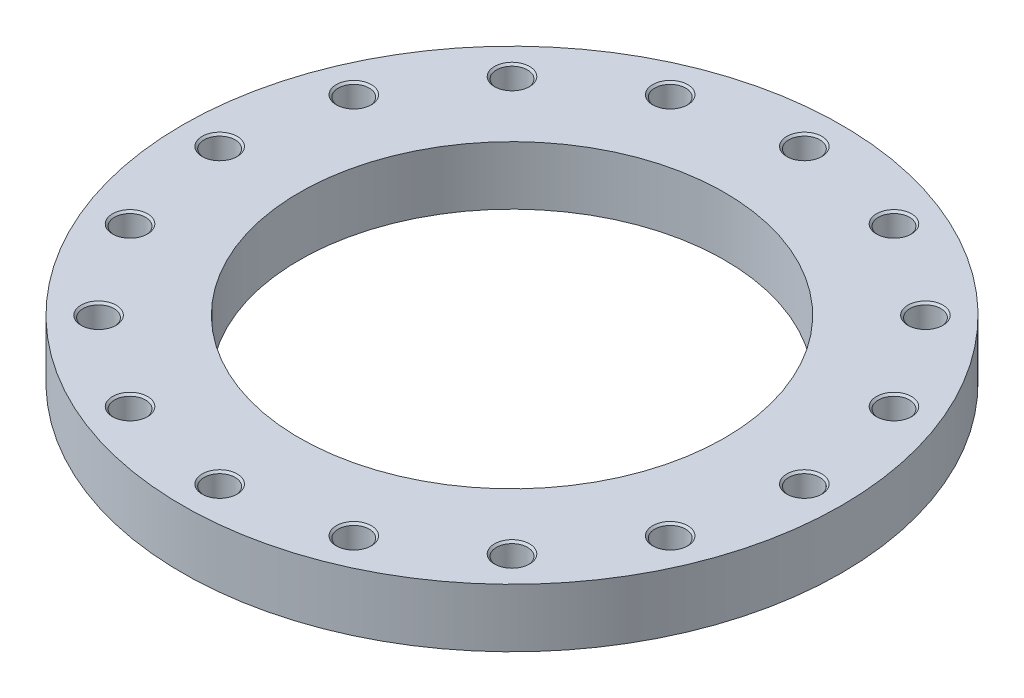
ISO-10303-21;
HEADER;
FILE_DESCRIPTION(('STEP AP214'),'2;1');
FILE_NAME('part.step','',(''),(''),'','','');
FILE_SCHEMA(('AUTOMOTIVE_DESIGN { 1 0 10303 214 1 1 1 1 }'));
ENDSEC;
DATA;
#1=APPLICATION_CONTEXT('core data for automotive mechanical design processes');
#2=APPLICATION_PROTOCOL_DEFINITION('international standard','automotive_design',2000,#1);
#3=PRODUCT_CONTEXT('',#1,'mechanical');
#4=PRODUCT('Part','Part','',(#3));
#5=PRODUCT_RELATED_PRODUCT_CATEGORY('part','',(#4));
#6=PRODUCT_DEFINITION_FORMATION('','',#4);
#7=PRODUCT_DEFINITION_CONTEXT('part definition',#1,'design');
#8=PRODUCT_DEFINITION('design','',#6,#7);
#9=PRODUCT_DEFINITION_SHAPE('','',#8);
#10=(LENGTH_UNIT() NAMED_UNIT(*) SI_UNIT(.MILLI.,.METRE.));
#11=(NAMED_UNIT(*) PLANE_ANGLE_UNIT() SI_UNIT($,.RADIAN.));
#12=(NAMED_UNIT(*) SI_UNIT($,.STERADIAN.) SOLID_ANGLE_UNIT());
#13=UNCERTAINTY_MEASURE_WITH_UNIT(LENGTH_MEASURE(1.E-05),#10,'distance_accuracy_value','');
#14=(GEOMETRIC_REPRESENTATION_CONTEXT(3) GLOBAL_UNCERTAINTY_ASSIGNED_CONTEXT((#13)) GLOBAL_UNIT_ASSIGNED_CONTEXT((#10,
#11,#12)) REPRESENTATION_CONTEXT('',''));
#15=CARTESIAN_POINT('',(0.,0.,0.));
#16=DIRECTION('',(0.,0.,1.));
#17=DIRECTION('',(1.,0.,0.));
#18=AXIS2_PLACEMENT_3D('',#15,#16,#17);
#19=CARTESIAN_POINT('',(0.,27.5,0.));
#20=DIRECTION('',(0.,-1.,0.));
#21=DIRECTION('',(1.,0.,0.));
#22=AXIS2_PLACEMENT_3D('',#19,#20,#21);
#23=CYLINDRICAL_SURFACE('',#22,310.);
#24=CARTESIAN_POINT('',(0.,0.,0.));
#25=DIRECTION('',(0.,1.,0.));
#26=DIRECTION('',(1.,0.,0.));
#27=AXIS2_PLACEMENT_3D('',#24,#25,#26);
#28=CIRCLE('',#27,310.);
#29=CARTESIAN_POINT('',(310.,0.,0.));
#30=VERTEX_POINT('',#29);
#31=EDGE_CURVE('E9',#30,#30,#28,.T.);
#32=ORIENTED_EDGE('',*,*,#31,.T.);
#33=EDGE_LOOP('',(#32));
#34=FACE_BOUND('',#33,.T.);
#35=CARTESIAN_POINT('',(0.,55.,0.));
#36=DIRECTION('',(0.,1.,0.));
#37=DIRECTION('',(1.,0.,0.));
#38=AXIS2_PLACEMENT_3D('',#35,#36,#37);
#39=CIRCLE('',#38,310.);
#40=CARTESIAN_POINT('',(310.,55.,0.));
#41=VERTEX_POINT('',#40);
#42=EDGE_CURVE('E69',#41,#41,#39,.T.);
#43=ORIENTED_EDGE('',*,*,#42,.F.);
#44=EDGE_LOOP('',(#43));
#45=FACE_BOUND('',#44,.T.);
#46=ADVANCED_FACE('F15',(#34,#45),#23,.T.);
#47=CARTESIAN_POINT('',(255.,0.,0.));
#48=DIRECTION('',(0.,-1.,0.));
#49=DIRECTION('',(-1.,0.,0.));
#50=AXIS2_PLACEMENT_3D('',#47,#48,#49);
#51=PLANE('',#50);
#52=CARTESIAN_POINT('',(0.,0.,0.));
#53=DIRECTION('',(0.,1.,0.));
#54=DIRECTION('',(1.,0.,0.));
#55=AXIS2_PLACEMENT_3D('',#52,#53,#54);
#56=CIRCLE('',#55,200.);
#57=CARTESIAN_POINT('',(200.,0.,0.));
#58=VERTEX_POINT('',#57);
#59=EDGE_CURVE('E18',#58,#58,#56,.T.);
#60=ORIENTED_EDGE('',*,*,#59,.T.);
#61=EDGE_LOOP('',(#60));
#62=FACE_BOUND('',#61,.T.);
#63=ORIENTED_EDGE('',*,*,#31,.F.);
#64=EDGE_LOOP('',(#63));
#65=FACE_BOUND('',#64,.T.);
#66=ADVANCED_FACE('F627',(#62,#65),#51,.T.);
#67=CARTESIAN_POINT('',(0.,27.5,0.));
#68=DIRECTION('',(0.,-1.,0.));
#69=DIRECTION('',(1.,0.,0.));
#70=AXIS2_PLACEMENT_3D('',#67,#68,#69);
#71=CYLINDRICAL_SURFACE('',#70,200.);
#72=CARTESIAN_POINT('',(0.,55.,0.));
#73=DIRECTION('',(0.,1.,0.));
#74=DIRECTION('',(1.,0.,0.));
#75=AXIS2_PLACEMENT_3D('',#72,#73,#74);
#76=CIRCLE('',#75,200.);
#77=CARTESIAN_POINT('',(200.,55.,0.));
#78=VERTEX_POINT('',#77);
#79=EDGE_CURVE('E73',#78,#78,#76,.T.);
#80=ORIENTED_EDGE('',*,*,#79,.T.);
#81=EDGE_LOOP('',(#80));
#82=FACE_BOUND('',#81,.T.);
#83=ORIENTED_EDGE('',*,*,#59,.F.);
#84=EDGE_LOOP('',(#83));
#85=FACE_BOUND('',#84,.T.);
#86=ADVANCED_FACE('F631',(#82,#85),#71,.F.);
#87=CARTESIAN_POINT('',(255.,55.,0.));
#88=DIRECTION('',(0.,1.,0.));
#89=DIRECTION('',(1.,0.,0.));
#90=AXIS2_PLACEMENT_3D('',#87,#88,#89);
#91=PLANE('',#90);
#92=ORIENTED_EDGE('',*,*,#42,.T.);
#93=EDGE_LOOP('',(#92));
#94=FACE_BOUND('',#93,.T.);
#95=ORIENTED_EDGE('',*,*,#79,.F.);
#96=EDGE_LOOP('',(#95));
#97=FACE_BOUND('',#96,.T.);
#98=CARTESIAN_POINT('',(275.,55.,0.));
#99=DIRECTION('',(0.,-1.,0.));
#100=DIRECTION('',(1.,0.,0.));
#101=AXIS2_PLACEMENT_3D('',#98,#99,#100);
#102=CIRCLE('',#101,16.5);
#103=CARTESIAN_POINT('',(291.5,55.,0.));
#104=VERTEX_POINT('',#103);
#105=EDGE_CURVE('E85',#104,#104,#102,.T.);
#106=ORIENTED_EDGE('',*,*,#105,.T.);
#107=EDGE_LOOP('',(#106));
#108=FACE_BOUND('',#107,.T.);
#109=CARTESIAN_POINT('',(254.066871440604,55.,-105.2379439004));
#110=DIRECTION('',(0.,-1.,0.));
#111=DIRECTION('',(0.923879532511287,0.,-0.38268343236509));
#112=AXIS2_PLACEMENT_3D('',#109,#110,#111);
#113=CIRCLE('',#112,16.5);
#114=CARTESIAN_POINT('',(269.31088372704,55.,-111.552220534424));
#115=VERTEX_POINT('',#114);
#116=EDGE_CURVE('E93',#115,#115,#113,.T.);
#117=ORIENTED_EDGE('',*,*,#116,.T.);
#118=EDGE_LOOP('',(#117));
#119=FACE_BOUND('',#118,.T.);
#120=CARTESIAN_POINT('',(194.4543648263,55.,-194.4543648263));
#121=DIRECTION('',(0.,-1.,0.));
#122=DIRECTION('',(0.707106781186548,0.,-0.707106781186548));
#123=AXIS2_PLACEMENT_3D('',#120,#121,#122);
#124=CIRCLE('',#123,16.5);
#125=CARTESIAN_POINT('',(206.121626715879,55.,-206.121626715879));
#126=VERTEX_POINT('',#125);
#127=EDGE_CURVE('E104',#126,#126,#124,.T.);
#128=ORIENTED_EDGE('',*,*,#127,.T.);
#129=EDGE_LOOP('',(#128));
#130=FACE_BOUND('',#129,.T.);
#131=CARTESIAN_POINT('',(105.2379439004,55.,-254.066871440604));
#132=DIRECTION('',(0.,-1.,0.));
#133=DIRECTION('',(0.38268343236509,0.,-0.923879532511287));
#134=AXIS2_PLACEMENT_3D('',#131,#132,#133);
#135=CIRCLE('',#134,16.5);
#136=CARTESIAN_POINT('',(111.552220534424,55.,-269.31088372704));
#137=VERTEX_POINT('',#136);
#138=EDGE_CURVE('E117',#137,#137,#135,.T.);
#139=ORIENTED_EDGE('',*,*,#138,.T.);
#140=EDGE_LOOP('',(#139));
#141=FACE_BOUND('',#140,.T.);
#142=CARTESIAN_POINT('',(0.,55.,-275.));
#143=DIRECTION('',(0.,-1.,0.));
#144=DIRECTION('',(0.,0.,-1.));
#145=AXIS2_PLACEMENT_3D('',#142,#143,#144);
#146=CIRCLE('',#145,16.5);
#147=CARTESIAN_POINT('',(0.,55.,-291.5));
#148=VERTEX_POINT('',#147);
#149=EDGE_CURVE('E133',#148,#148,#146,.T.);
#150=ORIENTED_EDGE('',*,*,#149,.T.);
#151=EDGE_LOOP('',(#150));
#152=FACE_BOUND('',#151,.T.);
#153=CARTESIAN_POINT('',(-105.2379439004,55.,-254.066871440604));
#154=DIRECTION('',(0.,-1.,0.));
#155=DIRECTION('',(-0.38268343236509,0.,-0.923879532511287));
#156=AXIS2_PLACEMENT_3D('',#153,#154,#155);
#157=CIRCLE('',#156,16.5);
#158=CARTESIAN_POINT('',(-111.552220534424,55.,-269.31088372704));
#159=VERTEX_POINT('',#158);
#160=EDGE_CURVE('E143',#159,#159,#157,.T.);
#161=ORIENTED_EDGE('',*,*,#160,.T.);
#162=EDGE_LOOP('',(#161));
#163=FACE_BOUND('',#162,.T.);
#164=CARTESIAN_POINT('',(-194.4543648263,55.,-194.4543648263));
#165=DIRECTION('',(0.,-1.,0.));
#166=DIRECTION('',(-0.707106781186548,0.,-0.707106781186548));
#167=AXIS2_PLACEMENT_3D('',#164,#165,#166);
#168=CIRCLE('',#167,16.5);
#169=CARTESIAN_POINT('',(-206.121626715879,55.,-206.121626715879));
#170=VERTEX_POINT('',#169);
#171=EDGE_CURVE('E157',#170,#170,#168,.T.);
#172=ORIENTED_EDGE('',*,*,#171,.T.);
#173=EDGE_LOOP('',(#172));
#174=FACE_BOUND('',#173,.T.);
#175=CARTESIAN_POINT('',(-254.066871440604,55.,-105.2379439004));
#176=DIRECTION('',(0.,-1.,0.));
#177=DIRECTION('',(-0.923879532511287,0.,-0.38268343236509));
#178=AXIS2_PLACEMENT_3D('',#175,#176,#177);
#179=CIRCLE('',#178,16.5);
#180=CARTESIAN_POINT('',(-269.31088372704,55.,-111.552220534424));
#181=VERTEX_POINT('',#180);
#182=EDGE_CURVE('E175',#181,#181,#179,.T.);
#183=ORIENTED_EDGE('',*,*,#182,.T.);
#184=EDGE_LOOP('',(#183));
#185=FACE_BOUND('',#184,.T.);
#186=CARTESIAN_POINT('',(-275.,55.,0.));
#187=DIRECTION('',(0.,-1.,0.));
#188=DIRECTION('',(-1.,0.,0.));
#189=AXIS2_PLACEMENT_3D('',#186,#187,#188);
#190=CIRCLE('',#189,16.5);
#191=CARTESIAN_POINT('',(-291.5,55.,0.));
#192=VERTEX_POINT('',#191);
#193=EDGE_CURVE('E196',#192,#192,#190,.T.);
#194=ORIENTED_EDGE('',*,*,#193,.T.);
#195=EDGE_LOOP('',(#194));
#196=FACE_BOUND('',#195,.T.);
#197=CARTESIAN_POINT('',(-254.066871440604,55.,105.2379439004));
#198=DIRECTION('',(0.,-1.,0.));
#199=DIRECTION('',(-0.923879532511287,0.,0.38268343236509));
#200=AXIS2_PLACEMENT_3D('',#197,#198,#199);
#201=CIRCLE('',#200,16.5);
#202=CARTESIAN_POINT('',(-269.31088372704,55.,111.552220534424));
#203=VERTEX_POINT('',#202);
#204=EDGE_CURVE('E218',#203,#203,#201,.T.);
#205=ORIENTED_EDGE('',*,*,#204,.T.);
#206=EDGE_LOOP('',(#205));
#207=FACE_BOUND('',#206,.T.);
#208=CARTESIAN_POINT('',(-194.4543648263,55.,194.4543648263));
#209=DIRECTION('',(0.,-1.,0.));
#210=DIRECTION('',(-0.707106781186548,0.,0.707106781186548));
#211=AXIS2_PLACEMENT_3D('',#208,#209,#210);
#212=CIRCLE('',#211,16.5);
#213=CARTESIAN_POINT('',(-206.121626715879,55.,206.121626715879));
#214=VERTEX_POINT('',#213);
#215=EDGE_CURVE('E238',#214,#214,#212,.T.);
#216=ORIENTED_EDGE('',*,*,#215,.T.);
#217=EDGE_LOOP('',(#216));
#218=FACE_BOUND('',#217,.T.);
#219=CARTESIAN_POINT('',(-105.2379439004,55.,254.066871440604));
#220=DIRECTION('',(0.,-1.,0.));
#221=DIRECTION('',(-0.382683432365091,0.,0.923879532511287));
#222=AXIS2_PLACEMENT_3D('',#219,#220,#221);
#223=CIRCLE('',#222,16.5);
#224=CARTESIAN_POINT('',(-111.552220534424,55.,269.31088372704));
#225=VERTEX_POINT('',#224);
#226=EDGE_CURVE('E258',#225,#225,#223,.T.);
#227=ORIENTED_EDGE('',*,*,#226,.T.);
#228=EDGE_LOOP('',(#227));
#229=FACE_BOUND('',#228,.T.);
#230=CARTESIAN_POINT('',(0.,55.,275.));
#231=DIRECTION('',(0.,-1.,0.));
#232=DIRECTION('',(0.,0.,1.));
#233=AXIS2_PLACEMENT_3D('',#230,#231,#232);
#234=CIRCLE('',#233,16.5);
#235=CARTESIAN_POINT('',(0.,55.,291.5));
#236=VERTEX_POINT('',#235);
#237=EDGE_CURVE('E280',#236,#236,#234,.T.);
#238=ORIENTED_EDGE('',*,*,#237,.T.);
#239=EDGE_LOOP('',(#238));
#240=FACE_BOUND('',#239,.T.);
#241=CARTESIAN_POINT('',(105.2379439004,55.,254.066871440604));
#242=DIRECTION('',(0.,-1.,0.));
#243=DIRECTION('',(0.38268343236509,0.,0.923879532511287));
#244=AXIS2_PLACEMENT_3D('',#241,#242,#243);
#245=CIRCLE('',#244,16.5);
#246=CARTESIAN_POINT('',(111.552220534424,55.,269.31088372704));
#247=VERTEX_POINT('',#246);
#248=EDGE_CURVE('E303',#247,#247,#245,.T.);
#249=ORIENTED_EDGE('',*,*,#248,.T.);
#250=EDGE_LOOP('',(#249));
#251=FACE_BOUND('',#250,.T.);
#252=CARTESIAN_POINT('',(194.4543648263,55.,194.4543648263));
#253=DIRECTION('',(0.,-1.,0.));
#254=DIRECTION('',(0.707106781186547,0.,0.707106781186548));
#255=AXIS2_PLACEMENT_3D('',#252,#253,#254);
#256=CIRCLE('',#255,16.5);
#257=CARTESIAN_POINT('',(206.121626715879,55.,206.121626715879));
#258=VERTEX_POINT('',#257);
#259=EDGE_CURVE('E320',#258,#258,#256,.T.);
#260=ORIENTED_EDGE('',*,*,#259,.T.);
#261=EDGE_LOOP('',(#260));
#262=FACE_BOUND('',#261,.T.);
#263=CARTESIAN_POINT('',(254.066871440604,55.,105.2379439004));
#264=DIRECTION('',(0.,-1.,0.));
#265=DIRECTION('',(0.923879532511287,0.,0.382683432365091));
#266=AXIS2_PLACEMENT_3D('',#263,#264,#265);
#267=CIRCLE('',#266,16.5);
#268=CARTESIAN_POINT('',(269.31088372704,55.,111.552220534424));
#269=VERTEX_POINT('',#268);
#270=EDGE_CURVE('E338',#269,#269,#267,.T.);
#271=ORIENTED_EDGE('',*,*,#270,.T.);
#272=EDGE_LOOP('',(#271));
#273=FACE_BOUND('',#272,.T.);
#274=ADVANCED_FACE('F70',(#94,#97,#108,#119,#130,#141,#152,#163,#174,#185,#196,#207,#218,#229,
#240,#251,#262,#273),#91,.T.);
#275=CARTESIAN_POINT('',(275.,7.78371923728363,0.));
#276=DIRECTION('',(0.,1.,0.));
#277=DIRECTION('',(1.,0.,0.));
#278=AXIS2_PLACEMENT_3D('',#275,#276,#277);
#279=CONICAL_SURFACE('',#278,7.3028125,1.0471975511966);
#280=CARTESIAN_POINT('',(275.,12.,0.));
#281=DIRECTION('',(0.,-1.,0.));
#282=DIRECTION('',(1.,0.,0.));
#283=AXIS2_PLACEMENT_3D('',#280,#281,#282);
#284=CIRCLE('',#283,14.605625);
#285=CARTESIAN_POINT('',(289.605625,12.,0.));
#286=VERTEX_POINT('',#285);
#287=EDGE_CURVE('E74',#286,#286,#284,.T.);
#288=ORIENTED_EDGE('',*,*,#287,.F.);
#289=EDGE_LOOP('',(#288));
#290=FACE_BOUND('',#289,.T.);
#291=CARTESIAN_POINT('',(275.,3.56743847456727,0.));
#292=VERTEX_POINT('',#291);
#293=VERTEX_LOOP('',#292);
#294=FACE_BOUND('',#293,.T.);
#295=ADVANCED_FACE('F656',(#290,#294),#279,.F.);
#296=CARTESIAN_POINT('',(275.,16.5528125,0.));
#297=DIRECTION('',(0.,1.,0.));
#298=DIRECTION('',(1.,0.,0.));
#299=AXIS2_PLACEMENT_3D('',#296,#297,#298);
#300=CYLINDRICAL_SURFACE('',#299,14.605625);
#301=CARTESIAN_POINT('',(275.,21.105625,0.));
#302=DIRECTION('',(0.,-1.,0.));
#303=DIRECTION('',(1.,0.,0.));
#304=AXIS2_PLACEMENT_3D('',#301,#302,#303);
#305=CIRCLE('',#304,14.605625);
#306=CARTESIAN_POINT('',(289.605625,21.105625,0.));
#307=VERTEX_POINT('',#306);
#308=EDGE_CURVE('E79',#307,#307,#305,.T.);
#309=ORIENTED_EDGE('',*,*,#308,.F.);
#310=EDGE_LOOP('',(#309));
#311=FACE_BOUND('',#310,.T.);
#312=ORIENTED_EDGE('',*,*,#287,.T.);
#313=EDGE_LOOP('',(#312));
#314=FACE_BOUND('',#313,.T.);
#315=ADVANCED_FACE('F660',(#311,#314),#300,.F.);
#316=CARTESIAN_POINT('',(275.,22.0528125,0.));
#317=DIRECTION('',(0.,1.,0.));
#318=DIRECTION('',(1.,0.,0.));
#319=AXIS2_PLACEMENT_3D('',#316,#317,#318);
#320=CONICAL_SURFACE('',#319,15.5528125,0.785398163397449);
#321=CARTESIAN_POINT('',(275.,23.,0.));
#322=DIRECTION('',(0.,-1.,0.));
#323=DIRECTION('',(1.,0.,0.));
#324=AXIS2_PLACEMENT_3D('',#321,#322,#323);
#325=CIRCLE('',#324,16.5);
#326=CARTESIAN_POINT('',(291.5,23.,0.));
#327=VERTEX_POINT('',#326);
#328=EDGE_CURVE('E82',#327,#327,#325,.T.);
#329=ORIENTED_EDGE('',*,*,#328,.F.);
#330=EDGE_LOOP('',(#329));
#331=FACE_BOUND('',#330,.T.);
#332=ORIENTED_EDGE('',*,*,#308,.T.);
#333=EDGE_LOOP('',(#332));
#334=FACE_BOUND('',#333,.T.);
#335=ADVANCED_FACE('F666',(#331,#334),#320,.F.);
#336=CARTESIAN_POINT('',(290.5528125,23.,0.));
#337=DIRECTION('',(0.,1.,0.));
#338=DIRECTION('',(-1.,0.,0.));
#339=AXIS2_PLACEMENT_3D('',#336,#337,#338);
#340=PLANE('',#339);
#341=CARTESIAN_POINT('',(275.,23.,0.));
#342=DIRECTION('',(0.,-1.,0.));
#343=DIRECTION('',(1.,0.,0.));
#344=AXIS2_PLACEMENT_3D('',#341,#342,#343);
#345=CIRCLE('',#344,14.605625);
#346=CARTESIAN_POINT('',(289.605625,23.,0.));
#347=VERTEX_POINT('',#346);
#348=EDGE_CURVE('E83',#347,#347,#345,.T.);
#349=ORIENTED_EDGE('',*,*,#348,.F.);
#350=EDGE_LOOP('',(#349));
#351=FACE_BOUND('',#350,.T.);
#352=ORIENTED_EDGE('',*,*,#328,.T.);
#353=EDGE_LOOP('',(#352));
#354=FACE_BOUND('',#353,.T.);
#355=ADVANCED_FACE('F777',(#351,#354),#340,.F.);
#356=CARTESIAN_POINT('',(275.,38.0528125,0.));
#357=DIRECTION('',(0.,1.,0.));
#358=DIRECTION('',(1.,0.,0.));
#359=AXIS2_PLACEMENT_3D('',#356,#357,#358);
#360=CYLINDRICAL_SURFACE('',#359,14.605625);
#361=CARTESIAN_POINT('',(275.,53.105625,0.));
#362=DIRECTION('',(0.,-1.,0.));
#363=DIRECTION('',(1.,0.,0.));
#364=AXIS2_PLACEMENT_3D('',#361,#362,#363);
#365=CIRCLE('',#364,14.605625);
#366=CARTESIAN_POINT('',(289.605625,53.105625,0.));
#367=VERTEX_POINT('',#366);
#368=EDGE_CURVE('E86',#367,#367,#365,.T.);
#369=ORIENTED_EDGE('',*,*,#368,.F.);
#370=EDGE_LOOP('',(#369));
#371=FACE_BOUND('',#370,.T.);
#372=ORIENTED_EDGE('',*,*,#348,.T.);
#373=EDGE_LOOP('',(#372));
#374=FACE_BOUND('',#373,.T.);
#375=ADVANCED_FACE('F644',(#371,#374),#360,.F.);
#376=CARTESIAN_POINT('',(275.,54.0528125,0.));
#377=DIRECTION('',(0.,1.,0.));
#378=DIRECTION('',(1.,0.,0.));
#379=AXIS2_PLACEMENT_3D('',#376,#377,#378);
#380=CONICAL_SURFACE('',#379,15.5528125,0.785398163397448);
#381=ORIENTED_EDGE('',*,*,#105,.F.);
#382=EDGE_LOOP('',(#381));
#383=FACE_BOUND('',#382,.T.);
#384=ORIENTED_EDGE('',*,*,#368,.T.);
#385=EDGE_LOOP('',(#384));
#386=FACE_BOUND('',#385,.T.);
#387=ADVANCED_FACE('F640',(#383,#386),#380,.F.);
#388=CARTESIAN_POINT('',(254.066871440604,7.78371923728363,-105.2379439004));
#389=DIRECTION('',(0.,1.,0.));
#390=DIRECTION('',(0.923879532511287,0.,-0.38268343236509));
#391=AXIS2_PLACEMENT_3D('',#388,#389,#390);
#392=CONICAL_SURFACE('',#391,7.3028125,1.0471975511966);
#393=CARTESIAN_POINT('',(254.066871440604,12.,-105.2379439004));
#394=DIRECTION('',(0.,-1.,0.));
#395=DIRECTION('',(0.923879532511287,0.,-0.38268343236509));
#396=AXIS2_PLACEMENT_3D('',#393,#394,#395);
#397=CIRCLE('',#396,14.605625);
#398=CARTESIAN_POINT('',(267.560709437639,12.,-110.827274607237));
#399=VERTEX_POINT('',#398);
#400=EDGE_CURVE('E89',#399,#399,#397,.T.);
#401=ORIENTED_EDGE('',*,*,#400,.F.);
#402=EDGE_LOOP('',(#401));
#403=FACE_BOUND('',#402,.T.);
#404=CARTESIAN_POINT('',(254.066871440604,3.56743847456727,-105.2379439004));
#405=VERTEX_POINT('',#404);
#406=VERTEX_LOOP('',#405);
#407=FACE_BOUND('',#406,.T.);
#408=ADVANCED_FACE('F643',(#403,#407),#392,.F.);
#409=CARTESIAN_POINT('',(254.066871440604,16.5528125,-105.2379439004));
#410=DIRECTION('',(0.,1.,0.));
#411=DIRECTION('',(0.923879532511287,0.,-0.38268343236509));
#412=AXIS2_PLACEMENT_3D('',#409,#410,#411);
#413=CYLINDRICAL_SURFACE('',#412,14.605625);
#414=CARTESIAN_POINT('',(254.066871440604,21.105625,-105.2379439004));
#415=DIRECTION('',(0.,-1.,0.));
#416=DIRECTION('',(0.923879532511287,0.,-0.38268343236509));
#417=AXIS2_PLACEMENT_3D('',#414,#415,#416);
#418=CIRCLE('',#417,14.605625);
#419=CARTESIAN_POINT('',(267.560709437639,21.105625,-110.827274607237));
#420=VERTEX_POINT('',#419);
#421=EDGE_CURVE('E90',#420,#420,#418,.T.);
#422=ORIENTED_EDGE('',*,*,#421,.F.);
#423=EDGE_LOOP('',(#422));
#424=FACE_BOUND('',#423,.T.);
#425=ORIENTED_EDGE('',*,*,#400,.T.);
#426=EDGE_LOOP('',(#425));
#427=FACE_BOUND('',#426,.T.);
#428=ADVANCED_FACE('F650',(#424,#427),#413,.F.);
#429=CARTESIAN_POINT('',(254.066871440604,22.0528125,-105.2379439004));
#430=DIRECTION('',(0.,1.,0.));
#431=DIRECTION('',(0.923879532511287,0.,-0.38268343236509));
#432=AXIS2_PLACEMENT_3D('',#429,#430,#431);
#433=CONICAL_SURFACE('',#432,15.5528125,0.785398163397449);
#434=CARTESIAN_POINT('',(254.066871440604,23.,-105.2379439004));
#435=DIRECTION('',(0.,-1.,0.));
#436=DIRECTION('',(0.923879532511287,0.,-0.38268343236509));
#437=AXIS2_PLACEMENT_3D('',#434,#435,#436);
#438=CIRCLE('',#437,16.5);
#439=CARTESIAN_POINT('',(269.31088372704,23.,-111.552220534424));
#440=VERTEX_POINT('',#439);
#441=EDGE_CURVE('E92',#440,#440,#438,.T.);
#442=ORIENTED_EDGE('',*,*,#441,.F.);
#443=EDGE_LOOP('',(#442));
#444=FACE_BOUND('',#443,.T.);
#445=ORIENTED_EDGE('',*,*,#421,.T.);
#446=EDGE_LOOP('',(#445));
#447=FACE_BOUND('',#446,.T.);
#448=ADVANCED_FACE('F646',(#444,#447),#433,.F.);
#449=CARTESIAN_POINT('',(268.435796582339,23.,-111.18974757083));
#450=DIRECTION('',(0.,1.,0.));
#451=DIRECTION('',(-0.923879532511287,0.,0.38268343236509));
#452=AXIS2_PLACEMENT_3D('',#449,#450,#451);
#453=PLANE('',#452);
#454=CARTESIAN_POINT('',(254.066871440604,23.,-105.2379439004));
#455=DIRECTION('',(0.,-1.,0.));
#456=DIRECTION('',(0.923879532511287,0.,-0.38268343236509));
#457=AXIS2_PLACEMENT_3D('',#454,#455,#456);
#458=CIRCLE('',#457,14.605625);
#459=CARTESIAN_POINT('',(267.560709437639,23.,-110.827274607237));
#460=VERTEX_POINT('',#459);
#461=EDGE_CURVE('E95',#460,#460,#458,.T.);
#462=ORIENTED_EDGE('',*,*,#461,.F.);
#463=EDGE_LOOP('',(#462));
#464=FACE_BOUND('',#463,.T.);
#465=ORIENTED_EDGE('',*,*,#441,.T.);
#466=EDGE_LOOP('',(#465));
#467=FACE_BOUND('',#466,.T.);
#468=ADVANCED_FACE('F649',(#464,#467),#453,.F.);
#469=CARTESIAN_POINT('',(254.066871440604,38.0528125,-105.2379439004));
#470=DIRECTION('',(0.,1.,0.));
#471=DIRECTION('',(0.923879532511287,0.,-0.38268343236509));
#472=AXIS2_PLACEMENT_3D('',#469,#470,#471);
#473=CYLINDRICAL_SURFACE('',#472,14.605625);
#474=CARTESIAN_POINT('',(254.066871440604,53.105625,-105.2379439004));
#475=DIRECTION('',(0.,-1.,0.));
#476=DIRECTION('',(0.923879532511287,0.,-0.38268343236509));
#477=AXIS2_PLACEMENT_3D('',#474,#475,#476);
#478=CIRCLE('',#477,14.605625);
#479=CARTESIAN_POINT('',(267.560709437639,53.105625,-110.827274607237));
#480=VERTEX_POINT('',#479);
#481=EDGE_CURVE('E96',#480,#480,#478,.T.);
#482=ORIENTED_EDGE('',*,*,#481,.F.);
#483=EDGE_LOOP('',(#482));
#484=FACE_BOUND('',#483,.T.);
#485=ORIENTED_EDGE('',*,*,#461,.T.);
#486=EDGE_LOOP('',(#485));
#487=FACE_BOUND('',#486,.T.);
#488=ADVANCED_FACE('F623',(#484,#487),#473,.F.);
#489=CARTESIAN_POINT('',(254.066871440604,54.0528125,-105.2379439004));
#490=DIRECTION('',(0.,1.,0.));
#491=DIRECTION('',(0.923879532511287,0.,-0.38268343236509));
#492=AXIS2_PLACEMENT_3D('',#489,#490,#491);
#493=CONICAL_SURFACE('',#492,15.5528125,0.785398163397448);
#494=ORIENTED_EDGE('',*,*,#116,.F.);
#495=EDGE_LOOP('',(#494));
#496=FACE_BOUND('',#495,.T.);
#497=ORIENTED_EDGE('',*,*,#481,.T.);
#498=EDGE_LOOP('',(#497));
#499=FACE_BOUND('',#498,.T.);
#500=ADVANCED_FACE('F617',(#496,#499),#493,.F.);
#501=CARTESIAN_POINT('',(194.4543648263,7.78371923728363,-194.4543648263));
#502=DIRECTION('',(0.,1.,0.));
#503=DIRECTION('',(0.707106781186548,0.,-0.707106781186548));
#504=AXIS2_PLACEMENT_3D('',#501,#502,#503);
#505=CONICAL_SURFACE('',#504,7.3028125,1.0471975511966);
#506=CARTESIAN_POINT('',(194.4543648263,12.,-194.4543648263));
#507=DIRECTION('',(0.,-1.,0.));
#508=DIRECTION('',(0.707106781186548,0.,-0.707106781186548));
#509=AXIS2_PLACEMENT_3D('',#506,#507,#508);
#510=CIRCLE('',#509,14.605625);
#511=CARTESIAN_POINT('',(204.782101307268,12.,-204.782101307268));
#512=VERTEX_POINT('',#511);
#513=EDGE_CURVE('E97',#512,#512,#510,.T.);
#514=ORIENTED_EDGE('',*,*,#513,.F.);
#515=EDGE_LOOP('',(#514));
#516=FACE_BOUND('',#515,.T.);
#517=CARTESIAN_POINT('',(194.4543648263,3.56743847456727,-194.4543648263));
#518=VERTEX_POINT('',#517);
#519=VERTEX_LOOP('',#518);
#520=FACE_BOUND('',#519,.T.);
#521=ADVANCED_FACE('F610',(#516,#520),#505,.F.);
#522=CARTESIAN_POINT('',(194.4543648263,16.5528125,-194.4543648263));
#523=DIRECTION('',(0.,1.,0.));
#524=DIRECTION('',(0.707106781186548,0.,-0.707106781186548));
#525=AXIS2_PLACEMENT_3D('',#522,#523,#524);
#526=CYLINDRICAL_SURFACE('',#525,14.605625);
#527=CARTESIAN_POINT('',(194.4543648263,21.105625,-194.4543648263));
#528=DIRECTION('',(0.,-1.,0.));
#529=DIRECTION('',(0.707106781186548,0.,-0.707106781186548));
#530=AXIS2_PLACEMENT_3D('',#527,#528,#529);
#531=CIRCLE('',#530,14.605625);
#532=CARTESIAN_POINT('',(204.782101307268,21.105625,-204.782101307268));
#533=VERTEX_POINT('',#532);
#534=EDGE_CURVE('E100',#533,#533,#531,.T.);
#535=ORIENTED_EDGE('',*,*,#534,.F.);
#536=EDGE_LOOP('',(#535));
#537=FACE_BOUND('',#536,.T.);
#538=ORIENTED_EDGE('',*,*,#513,.T.);
#539=EDGE_LOOP('',(#538));
#540=FACE_BOUND('',#539,.T.);
#541=ADVANCED_FACE('F603',(#537,#540),#526,.F.);
#542=CARTESIAN_POINT('',(194.4543648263,22.0528125,-194.4543648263));
#543=DIRECTION('',(0.,1.,0.));
#544=DIRECTION('',(0.707106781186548,0.,-0.707106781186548));
#545=AXIS2_PLACEMENT_3D('',#542,#543,#544);
#546=CONICAL_SURFACE('',#545,15.5528125,0.785398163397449);
#547=CARTESIAN_POINT('',(194.4543648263,23.,-194.4543648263));
#548=DIRECTION('',(0.,-1.,0.));
#549=DIRECTION('',(0.707106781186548,0.,-0.707106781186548));
#550=AXIS2_PLACEMENT_3D('',#547,#548,#549);
#551=CIRCLE('',#550,16.5);
#552=CARTESIAN_POINT('',(206.121626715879,23.,-206.121626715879));
#553=VERTEX_POINT('',#552);
#554=EDGE_CURVE('E103',#553,#553,#551,.T.);
#555=ORIENTED_EDGE('',*,*,#554,.F.);
#556=EDGE_LOOP('',(#555));
#557=FACE_BOUND('',#556,.T.);
#558=ORIENTED_EDGE('',*,*,#534,.T.);
#559=EDGE_LOOP('',(#558));
#560=FACE_BOUND('',#559,.T.);
#561=ADVANCED_FACE('F597',(#557,#560),#546,.F.);
#562=CARTESIAN_POINT('',(205.451864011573,23.,-205.451864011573));
#563=DIRECTION('',(0.,1.,0.));
#564=DIRECTION('',(-0.707106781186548,0.,0.707106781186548));
#565=AXIS2_PLACEMENT_3D('',#562,#563,#564);
#566=PLANE('',#565);
#567=CARTESIAN_POINT('',(194.4543648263,23.,-194.4543648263));
#568=DIRECTION('',(0.,-1.,0.));
#569=DIRECTION('',(0.707106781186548,0.,-0.707106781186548));
#570=AXIS2_PLACEMENT_3D('',#567,#568,#569);
#571=CIRCLE('',#570,14.605625);
#572=CARTESIAN_POINT('',(204.782101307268,23.,-204.782101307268));
#573=VERTEX_POINT('',#572);
#574=EDGE_CURVE('E107',#573,#573,#571,.T.);
#575=ORIENTED_EDGE('',*,*,#574,.F.);
#576=EDGE_LOOP('',(#575));
#577=FACE_BOUND('',#576,.T.);
#578=ORIENTED_EDGE('',*,*,#554,.T.);
#579=EDGE_LOOP('',(#578));
#580=FACE_BOUND('',#579,.T.);
#581=ADVANCED_FACE('F594',(#577,#580),#566,.F.);
#582=CARTESIAN_POINT('',(194.4543648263,38.0528125,-194.4543648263));
#583=DIRECTION('',(0.,1.,0.));
#584=DIRECTION('',(0.707106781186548,0.,-0.707106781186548));
#585=AXIS2_PLACEMENT_3D('',#582,#583,#584);
#586=CYLINDRICAL_SURFACE('',#585,14.605625);
#587=CARTESIAN_POINT('',(194.4543648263,53.105625,-194.4543648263));
#588=DIRECTION('',(0.,-1.,0.));
#589=DIRECTION('',(0.707106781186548,0.,-0.707106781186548));
#590=AXIS2_PLACEMENT_3D('',#587,#588,#589);
#591=CIRCLE('',#590,14.605625);
#592=CARTESIAN_POINT('',(204.782101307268,53.105625,-204.782101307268));
#593=VERTEX_POINT('',#592);
#594=EDGE_CURVE('E108',#593,#593,#591,.T.);
#595=ORIENTED_EDGE('',*,*,#594,.F.);
#596=EDGE_LOOP('',(#595));
#597=FACE_BOUND('',#596,.T.);
#598=ORIENTED_EDGE('',*,*,#574,.T.);
#599=EDGE_LOOP('',(#598));
#600=FACE_BOUND('',#599,.T.);
#601=ADVANCED_FACE('F592',(#597,#600),#586,.F.);
#602=CARTESIAN_POINT('',(194.4543648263,54.0528125,-194.4543648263));
#603=DIRECTION('',(0.,1.,0.));
#604=DIRECTION('',(0.707106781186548,0.,-0.707106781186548));
#605=AXIS2_PLACEMENT_3D('',#602,#603,#604);
#606=CONICAL_SURFACE('',#605,15.5528125,0.785398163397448);
#607=ORIENTED_EDGE('',*,*,#127,.F.);
#608=EDGE_LOOP('',(#607));
#609=FACE_BOUND('',#608,.T.);
#610=ORIENTED_EDGE('',*,*,#594,.T.);
#611=EDGE_LOOP('',(#610));
#612=FACE_BOUND('',#611,.T.);
#613=ADVANCED_FACE('F765',(#609,#612),#606,.F.);
#614=CARTESIAN_POINT('',(105.2379439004,7.78371923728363,-254.066871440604));
#615=DIRECTION('',(0.,1.,0.));
#616=DIRECTION('',(0.38268343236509,0.,-0.923879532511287));
#617=AXIS2_PLACEMENT_3D('',#614,#615,#616);
#618=CONICAL_SURFACE('',#617,7.3028125,1.0471975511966);
#619=CARTESIAN_POINT('',(105.2379439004,12.,-254.066871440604));
#620=DIRECTION('',(0.,-1.,0.));
#621=DIRECTION('',(0.38268343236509,0.,-0.923879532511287));
#622=AXIS2_PLACEMENT_3D('',#619,#620,#621);
#623=CIRCLE('',#622,14.605625);
#624=CARTESIAN_POINT('',(110.827274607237,12.,-267.560709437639));
#625=VERTEX_POINT('',#624);
#626=EDGE_CURVE('E109',#625,#625,#623,.T.);
#627=ORIENTED_EDGE('',*,*,#626,.F.);
#628=EDGE_LOOP('',(#627));
#629=FACE_BOUND('',#628,.T.);
#630=CARTESIAN_POINT('',(105.2379439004,3.56743847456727,-254.066871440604));
#631=VERTEX_POINT('',#630);
#632=VERTEX_LOOP('',#631);
#633=FACE_BOUND('',#632,.T.);
#634=ADVANCED_FACE('F761',(#629,#633),#618,.F.);
#635=CARTESIAN_POINT('',(105.2379439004,16.5528125,-254.066871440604));
#636=DIRECTION('',(0.,1.,0.));
#637=DIRECTION('',(0.38268343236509,0.,-0.923879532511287));
#638=AXIS2_PLACEMENT_3D('',#635,#636,#637);
#639=CYLINDRICAL_SURFACE('',#638,14.605625);
#640=CARTESIAN_POINT('',(105.2379439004,21.105625,-254.066871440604));
#641=DIRECTION('',(0.,-1.,0.));
#642=DIRECTION('',(0.38268343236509,0.,-0.923879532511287));
#643=AXIS2_PLACEMENT_3D('',#640,#641,#642);
#644=CIRCLE('',#643,14.605625);
#645=CARTESIAN_POINT('',(110.827274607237,21.105625,-267.560709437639));
#646=VERTEX_POINT('',#645);
#647=EDGE_CURVE('E112',#646,#646,#644,.T.);
#648=ORIENTED_EDGE('',*,*,#647,.F.);
#649=EDGE_LOOP('',(#648));
#650=FACE_BOUND('',#649,.T.);
#651=ORIENTED_EDGE('',*,*,#626,.T.);
#652=EDGE_LOOP('',(#651));
#653=FACE_BOUND('',#652,.T.);
#654=ADVANCED_FACE('F764',(#650,#653),#639,.F.);
#655=CARTESIAN_POINT('',(105.2379439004,22.0528125,-254.066871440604));
#656=DIRECTION('',(0.,1.,0.));
#657=DIRECTION('',(0.38268343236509,0.,-0.923879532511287));
#658=AXIS2_PLACEMENT_3D('',#655,#656,#657);
#659=CONICAL_SURFACE('',#658,15.5528125,0.785398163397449);
#660=CARTESIAN_POINT('',(105.2379439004,23.,-254.066871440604));
#661=DIRECTION('',(0.,-1.,0.));
#662=DIRECTION('',(0.38268343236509,0.,-0.923879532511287));
#663=AXIS2_PLACEMENT_3D('',#660,#661,#662);
#664=CIRCLE('',#663,16.5);
#665=CARTESIAN_POINT('',(111.552220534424,23.,-269.31088372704));
#666=VERTEX_POINT('',#665);
#667=EDGE_CURVE('E113',#666,#666,#664,.T.);
#668=ORIENTED_EDGE('',*,*,#667,.F.);
#669=EDGE_LOOP('',(#668));
#670=FACE_BOUND('',#669,.T.);
#671=ORIENTED_EDGE('',*,*,#647,.T.);
#672=EDGE_LOOP('',(#671));
#673=FACE_BOUND('',#672,.T.);
#674=ADVANCED_FACE('F948',(#670,#673),#659,.F.);
#675=CARTESIAN_POINT('',(111.18974757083,23.,-268.435796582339));
#676=DIRECTION('',(0.,1.,0.));
#677=DIRECTION('',(-0.38268343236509,0.,0.923879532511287));
#678=AXIS2_PLACEMENT_3D('',#675,#676,#677);
#679=PLANE('',#678);
#680=CARTESIAN_POINT('',(105.2379439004,23.,-254.066871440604));
#681=DIRECTION('',(0.,-1.,0.));
#682=DIRECTION('',(0.38268343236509,0.,-0.923879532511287));
#683=AXIS2_PLACEMENT_3D('',#680,#681,#682);
#684=CIRCLE('',#683,14.605625);
#685=CARTESIAN_POINT('',(110.827274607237,23.,-267.560709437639));
#686=VERTEX_POINT('',#685);
#687=EDGE_CURVE('E116',#686,#686,#684,.T.);
#688=ORIENTED_EDGE('',*,*,#687,.F.);
#689=EDGE_LOOP('',(#688));
#690=FACE_BOUND('',#689,.T.);
#691=ORIENTED_EDGE('',*,*,#667,.T.);
#692=EDGE_LOOP('',(#691));
#693=FACE_BOUND('',#692,.T.);
#694=ADVANCED_FACE('F944',(#690,#693),#679,.F.);
#695=CARTESIAN_POINT('',(105.2379439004,38.0528125,-254.066871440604));
#696=DIRECTION('',(0.,1.,0.));
#697=DIRECTION('',(0.38268343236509,0.,-0.923879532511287));
#698=AXIS2_PLACEMENT_3D('',#695,#696,#697);
#699=CYLINDRICAL_SURFACE('',#698,14.605625);
#700=CARTESIAN_POINT('',(105.2379439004,53.105625,-254.066871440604));
#701=DIRECTION('',(0.,-1.,0.));
#702=DIRECTION('',(0.38268343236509,0.,-0.923879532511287));
#703=AXIS2_PLACEMENT_3D('',#700,#701,#702);
#704=CIRCLE('',#703,14.605625);
#705=CARTESIAN_POINT('',(110.827274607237,53.105625,-267.560709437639));
#706=VERTEX_POINT('',#705);
#707=EDGE_CURVE('E120',#706,#706,#704,.T.);
#708=ORIENTED_EDGE('',*,*,#707,.F.);
#709=EDGE_LOOP('',(#708));
#710=FACE_BOUND('',#709,.T.);
#711=ORIENTED_EDGE('',*,*,#687,.T.);
#712=EDGE_LOOP('',(#711));
#713=FACE_BOUND('',#712,.T.);
#714=ADVANCED_FACE('F940',(#710,#713),#699,.F.);
#715=CARTESIAN_POINT('',(105.2379439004,54.0528125,-254.066871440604));
#716=DIRECTION('',(0.,1.,0.));
#717=DIRECTION('',(0.38268343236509,0.,-0.923879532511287));
#718=AXIS2_PLACEMENT_3D('',#715,#716,#717);
#719=CONICAL_SURFACE('',#718,15.5528125,0.785398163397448);
#720=ORIENTED_EDGE('',*,*,#138,.F.);
#721=EDGE_LOOP('',(#720));
#722=FACE_BOUND('',#721,.T.);
#723=ORIENTED_EDGE('',*,*,#707,.T.);
#724=EDGE_LOOP('',(#723));
#725=FACE_BOUND('',#724,.T.);
#726=ADVANCED_FACE('F936',(#722,#725),#719,.F.);
#727=CARTESIAN_POINT('',(0.,7.78371923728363,-275.));
#728=DIRECTION('',(0.,1.,0.));
#729=DIRECTION('',(0.,0.,-1.));
#730=AXIS2_PLACEMENT_3D('',#727,#728,#729);
#731=CONICAL_SURFACE('',#730,7.3028125,1.0471975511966);
#732=CARTESIAN_POINT('',(0.,12.,-275.));
#733=DIRECTION('',(0.,-1.,0.));
#734=DIRECTION('',(0.,0.,-1.));
#735=AXIS2_PLACEMENT_3D('',#732,#733,#734);
#736=CIRCLE('',#735,14.605625);
#737=CARTESIAN_POINT('',(0.,12.,-289.605625));
#738=VERTEX_POINT('',#737);
#739=EDGE_CURVE('E123',#738,#738,#736,.T.);
#740=ORIENTED_EDGE('',*,*,#739,.F.);
#741=EDGE_LOOP('',(#740));
#742=FACE_BOUND('',#741,.T.);
#743=CARTESIAN_POINT('',(0.,3.56743847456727,-275.));
#744=VERTEX_POINT('',#743);
#745=VERTEX_LOOP('',#744);
#746=FACE_BOUND('',#745,.T.);
#747=ADVANCED_FACE('F932',(#742,#746),#731,.F.);
#748=CARTESIAN_POINT('',(0.,16.5528125,-275.));
#749=DIRECTION('',(0.,1.,0.));
#750=DIRECTION('',(0.,0.,-1.));
#751=AXIS2_PLACEMENT_3D('',#748,#749,#750);
#752=CYLINDRICAL_SURFACE('',#751,14.605625);
#753=CARTESIAN_POINT('',(0.,21.105625,-275.));
#754=DIRECTION('',(0.,-1.,0.));
#755=DIRECTION('',(0.,0.,-1.));
#756=AXIS2_PLACEMENT_3D('',#753,#754,#755);
#757=CIRCLE('',#756,14.605625);
#758=CARTESIAN_POINT('',(0.,21.105625,-289.605625));
#759=VERTEX_POINT('',#758);
#760=EDGE_CURVE('E126',#759,#759,#757,.T.);
#761=ORIENTED_EDGE('',*,*,#760,.F.);
#762=EDGE_LOOP('',(#761));
#763=FACE_BOUND('',#762,.T.);
#764=ORIENTED_EDGE('',*,*,#739,.T.);
#765=EDGE_LOOP('',(#764));
#766=FACE_BOUND('',#765,.T.);
#767=ADVANCED_FACE('F707',(#763,#766),#752,.F.);
#768=CARTESIAN_POINT('',(0.,22.0528125,-275.));
#769=DIRECTION('',(0.,1.,0.));
#770=DIRECTION('',(0.,0.,-1.));
#771=AXIS2_PLACEMENT_3D('',#768,#769,#770);
#772=CONICAL_SURFACE('',#771,15.5528125,0.785398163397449);
#773=CARTESIAN_POINT('',(0.,23.,-275.));
#774=DIRECTION('',(0.,-1.,0.));
#775=DIRECTION('',(0.,0.,-1.));
#776=AXIS2_PLACEMENT_3D('',#773,#774,#775);
#777=CIRCLE('',#776,16.5);
#778=CARTESIAN_POINT('',(0.,23.,-291.5));
#779=VERTEX_POINT('',#778);
#780=EDGE_CURVE('E129',#779,#779,#777,.T.);
#781=ORIENTED_EDGE('',*,*,#780,.F.);
#782=EDGE_LOOP('',(#781));
#783=FACE_BOUND('',#782,.T.);
#784=ORIENTED_EDGE('',*,*,#760,.T.);
#785=EDGE_LOOP('',(#784));
#786=FACE_BOUND('',#785,.T.);
#787=ADVANCED_FACE('F692',(#783,#786),#772,.F.);
#788=CARTESIAN_POINT('',(0.,23.,-290.5528125));
#789=DIRECTION('',(0.,1.,0.));
#790=DIRECTION('',(0.,0.,1.));
#791=AXIS2_PLACEMENT_3D('',#788,#789,#790);
#792=PLANE('',#791);
#793=CARTESIAN_POINT('',(0.,23.,-275.));
#794=DIRECTION('',(0.,-1.,0.));
#795=DIRECTION('',(0.,0.,-1.));
#796=AXIS2_PLACEMENT_3D('',#793,#794,#795);
#797=CIRCLE('',#796,14.605625);
#798=CARTESIAN_POINT('',(0.,23.,-289.605625));
#799=VERTEX_POINT('',#798);
#800=EDGE_CURVE('E130',#799,#799,#797,.T.);
#801=ORIENTED_EDGE('',*,*,#800,.F.);
#802=EDGE_LOOP('',(#801));
#803=FACE_BOUND('',#802,.T.);
#804=ORIENTED_EDGE('',*,*,#780,.T.);
#805=EDGE_LOOP('',(#804));
#806=FACE_BOUND('',#805,.T.);
#807=ADVANCED_FACE('F689',(#803,#806),#792,.F.);
#808=CARTESIAN_POINT('',(0.,38.0528125,-275.));
#809=DIRECTION('',(0.,1.,0.));
#810=DIRECTION('',(0.,0.,-1.));
#811=AXIS2_PLACEMENT_3D('',#808,#809,#810);
#812=CYLINDRICAL_SURFACE('',#811,14.605625);
#813=CARTESIAN_POINT('',(0.,53.105625,-275.));
#814=DIRECTION('',(0.,-1.,0.));
#815=DIRECTION('',(0.,0.,-1.));
#816=AXIS2_PLACEMENT_3D('',#813,#814,#815);
#817=CIRCLE('',#816,14.605625);
#818=CARTESIAN_POINT('',(0.,53.105625,-289.605625));
#819=VERTEX_POINT('',#818);
#820=EDGE_CURVE('E137',#819,#819,#817,.T.);
#821=ORIENTED_EDGE('',*,*,#820,.F.);
#822=EDGE_LOOP('',(#821));
#823=FACE_BOUND('',#822,.T.);
#824=ORIENTED_EDGE('',*,*,#800,.T.);
#825=EDGE_LOOP('',(#824));
#826=FACE_BOUND('',#825,.T.);
#827=ADVANCED_FACE('F691',(#823,#826),#812,.F.);
#828=CARTESIAN_POINT('',(0.,54.0528125,-275.));
#829=DIRECTION('',(0.,1.,0.));
#830=DIRECTION('',(0.,0.,-1.));
#831=AXIS2_PLACEMENT_3D('',#828,#829,#830);
#832=CONICAL_SURFACE('',#831,15.5528125,0.785398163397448);
#833=ORIENTED_EDGE('',*,*,#149,.F.);
#834=EDGE_LOOP('',(#833));
#835=FACE_BOUND('',#834,.T.);
#836=ORIENTED_EDGE('',*,*,#820,.T.);
#837=EDGE_LOOP('',(#836));
#838=FACE_BOUND('',#837,.T.);
#839=ADVANCED_FACE('F882',(#835,#838),#832,.F.);
#840=CARTESIAN_POINT('',(-105.2379439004,7.78371923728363,-254.066871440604));
#841=DIRECTION('',(0.,1.,0.));
#842=DIRECTION('',(-0.38268343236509,0.,-0.923879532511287));
#843=AXIS2_PLACEMENT_3D('',#840,#841,#842);
#844=CONICAL_SURFACE('',#843,7.3028125,1.0471975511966);
#845=CARTESIAN_POINT('',(-105.2379439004,12.,-254.066871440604));
#846=DIRECTION('',(0.,-1.,0.));
#847=DIRECTION('',(-0.38268343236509,0.,-0.923879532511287));
#848=AXIS2_PLACEMENT_3D('',#845,#846,#847);
#849=CIRCLE('',#848,14.605625);
#850=CARTESIAN_POINT('',(-110.827274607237,12.,-267.560709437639));
#851=VERTEX_POINT('',#850);
#852=EDGE_CURVE('E134',#851,#851,#849,.T.);
#853=ORIENTED_EDGE('',*,*,#852,.F.);
#854=EDGE_LOOP('',(#853));
#855=FACE_BOUND('',#854,.T.);
#856=CARTESIAN_POINT('',(-105.2379439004,3.56743847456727,-254.066871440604));
#857=VERTEX_POINT('',#856);
#858=VERTEX_LOOP('',#857);
#859=FACE_BOUND('',#858,.T.);
#860=ADVANCED_FACE('F698',(#855,#859),#844,.F.);
#861=CARTESIAN_POINT('',(-105.2379439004,16.5528125,-254.066871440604));
#862=DIRECTION('',(0.,1.,0.));
#863=DIRECTION('',(-0.38268343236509,0.,-0.923879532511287));
#864=AXIS2_PLACEMENT_3D('',#861,#862,#863);
#865=CYLINDRICAL_SURFACE('',#864,14.605625);
#866=CARTESIAN_POINT('',(-105.2379439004,21.105625,-254.066871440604));
#867=DIRECTION('',(0.,-1.,0.));
#868=DIRECTION('',(-0.38268343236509,0.,-0.923879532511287));
#869=AXIS2_PLACEMENT_3D('',#866,#867,#868);
#870=CIRCLE('',#869,14.605625);
#871=CARTESIAN_POINT('',(-110.827274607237,21.105625,-267.560709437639));
#872=VERTEX_POINT('',#871);
#873=EDGE_CURVE('E138',#872,#872,#870,.T.);
#874=ORIENTED_EDGE('',*,*,#873,.F.);
#875=EDGE_LOOP('',(#874));
#876=FACE_BOUND('',#875,.T.);
#877=ORIENTED_EDGE('',*,*,#852,.T.);
#878=EDGE_LOOP('',(#877));
#879=FACE_BOUND('',#878,.T.);
#880=ADVANCED_FACE('F695',(#876,#879),#865,.F.);
#881=CARTESIAN_POINT('',(-105.2379439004,22.0528125,-254.066871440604));
#882=DIRECTION('',(0.,1.,0.));
#883=DIRECTION('',(-0.38268343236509,0.,-0.923879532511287));
#884=AXIS2_PLACEMENT_3D('',#881,#882,#883);
#885=CONICAL_SURFACE('',#884,15.5528125,0.785398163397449);
#886=CARTESIAN_POINT('',(-105.2379439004,23.,-254.066871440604));
#887=DIRECTION('',(0.,-1.,0.));
#888=DIRECTION('',(-0.38268343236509,0.,-0.923879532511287));
#889=AXIS2_PLACEMENT_3D('',#886,#887,#888);
#890=CIRCLE('',#889,16.5);
#891=CARTESIAN_POINT('',(-111.552220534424,23.,-269.31088372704));
#892=VERTEX_POINT('',#891);
#893=EDGE_CURVE('E139',#892,#892,#890,.T.);
#894=ORIENTED_EDGE('',*,*,#893,.F.);
#895=EDGE_LOOP('',(#894));
#896=FACE_BOUND('',#895,.T.);
#897=ORIENTED_EDGE('',*,*,#873,.T.);
#898=EDGE_LOOP('',(#897));
#899=FACE_BOUND('',#898,.T.);
#900=ADVANCED_FACE('F697',(#896,#899),#885,.F.);
#901=CARTESIAN_POINT('',(-111.18974757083,23.,-268.435796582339));
#902=DIRECTION('',(0.,1.,0.));
#903=DIRECTION('',(0.38268343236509,0.,0.923879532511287));
#904=AXIS2_PLACEMENT_3D('',#901,#902,#903);
#905=PLANE('',#904);
#906=CARTESIAN_POINT('',(-105.2379439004,23.,-254.066871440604));
#907=DIRECTION('',(0.,-1.,0.));
#908=DIRECTION('',(-0.38268343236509,0.,-0.923879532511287));
#909=AXIS2_PLACEMENT_3D('',#906,#907,#908);
#910=CIRCLE('',#909,14.605625);
#911=CARTESIAN_POINT('',(-110.827274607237,23.,-267.560709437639));
#912=VERTEX_POINT('',#911);
#913=EDGE_CURVE('E142',#912,#912,#910,.T.);
#914=ORIENTED_EDGE('',*,*,#913,.F.);
#915=EDGE_LOOP('',(#914));
#916=FACE_BOUND('',#915,.T.);
#917=ORIENTED_EDGE('',*,*,#893,.T.);
#918=EDGE_LOOP('',(#917));
#919=FACE_BOUND('',#918,.T.);
#920=ADVANCED_FACE('F855',(#916,#919),#905,.F.);
#921=CARTESIAN_POINT('',(-105.2379439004,38.0528125,-254.066871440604));
#922=DIRECTION('',(0.,1.,0.));
#923=DIRECTION('',(-0.38268343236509,0.,-0.923879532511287));
#924=AXIS2_PLACEMENT_3D('',#921,#922,#923);
#925=CYLINDRICAL_SURFACE('',#924,14.605625);
#926=CARTESIAN_POINT('',(-105.2379439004,53.105625,-254.066871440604));
#927=DIRECTION('',(0.,-1.,0.));
#928=DIRECTION('',(-0.38268343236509,0.,-0.923879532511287));
#929=AXIS2_PLACEMENT_3D('',#926,#927,#928);
#930=CIRCLE('',#929,14.605625);
#931=CARTESIAN_POINT('',(-110.827274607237,53.105625,-267.560709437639));
#932=VERTEX_POINT('',#931);
#933=EDGE_CURVE('E146',#932,#932,#930,.T.);
#934=ORIENTED_EDGE('',*,*,#933,.F.);
#935=EDGE_LOOP('',(#934));
#936=FACE_BOUND('',#935,.T.);
#937=ORIENTED_EDGE('',*,*,#913,.T.);
#938=EDGE_LOOP('',(#937));
#939=FACE_BOUND('',#938,.T.);
#940=ADVANCED_FACE('F916',(#936,#939),#925,.F.);
#941=CARTESIAN_POINT('',(-105.2379439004,54.0528125,-254.066871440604));
#942=DIRECTION('',(0.,1.,0.));
#943=DIRECTION('',(-0.38268343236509,0.,-0.923879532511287));
#944=AXIS2_PLACEMENT_3D('',#941,#942,#943);
#945=CONICAL_SURFACE('',#944,15.5528125,0.785398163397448);
#946=ORIENTED_EDGE('',*,*,#160,.F.);
#947=EDGE_LOOP('',(#946));
#948=FACE_BOUND('',#947,.T.);
#949=ORIENTED_EDGE('',*,*,#933,.T.);
#950=EDGE_LOOP('',(#949));
#951=FACE_BOUND('',#950,.T.);
#952=ADVANCED_FACE('F913',(#948,#951),#945,.F.);
#953=CARTESIAN_POINT('',(-194.4543648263,7.78371923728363,-194.4543648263));
#954=DIRECTION('',(0.,1.,0.));
#955=DIRECTION('',(-0.707106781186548,0.,-0.707106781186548));
#956=AXIS2_PLACEMENT_3D('',#953,#954,#955);
#957=CONICAL_SURFACE('',#956,7.3028125,1.0471975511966);
#958=CARTESIAN_POINT('',(-194.4543648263,12.,-194.4543648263));
#959=DIRECTION('',(0.,-1.,0.));
#960=DIRECTION('',(-0.707106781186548,0.,-0.707106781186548));
#961=AXIS2_PLACEMENT_3D('',#958,#959,#960);
#962=CIRCLE('',#961,14.605625);
#963=CARTESIAN_POINT('',(-204.782101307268,12.,-204.782101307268));
#964=VERTEX_POINT('',#963);
#965=EDGE_CURVE('E149',#964,#964,#962,.T.);
#966=ORIENTED_EDGE('',*,*,#965,.F.);
#967=EDGE_LOOP('',(#966));
#968=FACE_BOUND('',#967,.T.);
#969=CARTESIAN_POINT('',(-194.4543648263,3.56743847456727,-194.4543648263));
#970=VERTEX_POINT('',#969);
#971=VERTEX_LOOP('',#970);
#972=FACE_BOUND('',#971,.T.);
#973=ADVANCED_FACE('F911',(#968,#972),#957,.F.);
#974=CARTESIAN_POINT('',(-194.4543648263,16.5528125,-194.4543648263));
#975=DIRECTION('',(0.,1.,0.));
#976=DIRECTION('',(-0.707106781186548,0.,-0.707106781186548));
#977=AXIS2_PLACEMENT_3D('',#974,#975,#976);
#978=CYLINDRICAL_SURFACE('',#977,14.605625);
#979=CARTESIAN_POINT('',(-194.4543648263,21.105625,-194.4543648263));
#980=DIRECTION('',(0.,-1.,0.));
#981=DIRECTION('',(-0.707106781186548,0.,-0.707106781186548));
#982=AXIS2_PLACEMENT_3D('',#979,#980,#981);
#983=CIRCLE('',#982,14.605625);
#984=CARTESIAN_POINT('',(-204.782101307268,21.105625,-204.782101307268));
#985=VERTEX_POINT('',#984);
#986=EDGE_CURVE('E153',#985,#985,#983,.T.);
#987=ORIENTED_EDGE('',*,*,#986,.F.);
#988=EDGE_LOOP('',(#987));
#989=FACE_BOUND('',#988,.T.);
#990=ORIENTED_EDGE('',*,*,#965,.T.);
#991=EDGE_LOOP('',(#990));
#992=FACE_BOUND('',#991,.T.);
#993=ADVANCED_FACE('F840',(#989,#992),#978,.F.);
#994=CARTESIAN_POINT('',(-194.4543648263,22.0528125,-194.4543648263));
#995=DIRECTION('',(0.,1.,0.));
#996=DIRECTION('',(-0.707106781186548,0.,-0.707106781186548));
#997=AXIS2_PLACEMENT_3D('',#994,#995,#996);
#998=CONICAL_SURFACE('',#997,15.5528125,0.785398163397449);
#999=CARTESIAN_POINT('',(-194.4543648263,23.,-194.4543648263));
#1000=DIRECTION('',(0.,-1.,0.));
#1001=DIRECTION('',(-0.707106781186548,0.,-0.707106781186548));
#1002=AXIS2_PLACEMENT_3D('',#999,#1000,#1001);
#1003=CIRCLE('',#1002,16.5);
#1004=CARTESIAN_POINT('',(-206.121626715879,23.,-206.121626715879));
#1005=VERTEX_POINT('',#1004);
#1006=EDGE_CURVE('E150',#1005,#1005,#1003,.T.);
#1007=ORIENTED_EDGE('',*,*,#1006,.F.);
#1008=EDGE_LOOP('',(#1007));
#1009=FACE_BOUND('',#1008,.T.);
#1010=ORIENTED_EDGE('',*,*,#986,.T.);
#1011=EDGE_LOOP('',(#1010));
#1012=FACE_BOUND('',#1011,.T.);
#1013=ADVANCED_FACE('F836',(#1009,#1012),#998,.F.);
#1014=CARTESIAN_POINT('',(-205.451864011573,23.,-205.451864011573));
#1015=DIRECTION('',(0.,1.,0.));
#1016=DIRECTION('',(0.707106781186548,0.,0.707106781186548));
#1017=AXIS2_PLACEMENT_3D('',#1014,#1015,#1016);
#1018=PLANE('',#1017);
#1019=CARTESIAN_POINT('',(-194.4543648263,23.,-194.4543648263));
#1020=DIRECTION('',(0.,-1.,0.));
#1021=DIRECTION('',(-0.707106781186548,0.,-0.707106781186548));
#1022=AXIS2_PLACEMENT_3D('',#1019,#1020,#1021);
#1023=CIRCLE('',#1022,14.605625);
#1024=CARTESIAN_POINT('',(-204.782101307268,23.,-204.782101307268));
#1025=VERTEX_POINT('',#1024);
#1026=EDGE_CURVE('E154',#1025,#1025,#1023,.T.);
#1027=ORIENTED_EDGE('',*,*,#1026,.F.);
#1028=EDGE_LOOP('',(#1027));
#1029=FACE_BOUND('',#1028,.T.);
#1030=ORIENTED_EDGE('',*,*,#1006,.T.);
#1031=EDGE_LOOP('',(#1030));
#1032=FACE_BOUND('',#1031,.T.);
#1033=ADVANCED_FACE('F839',(#1029,#1032),#1018,.F.);
#1034=CARTESIAN_POINT('',(-194.4543648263,38.0528125,-194.4543648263));
#1035=DIRECTION('',(0.,1.,0.));
#1036=DIRECTION('',(-0.707106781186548,0.,-0.707106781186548));
#1037=AXIS2_PLACEMENT_3D('',#1034,#1035,#1036);
#1038=CYLINDRICAL_SURFACE('',#1037,14.605625);
#1039=CARTESIAN_POINT('',(-194.4543648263,53.105625,-194.4543648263));
#1040=DIRECTION('',(0.,-1.,0.));
#1041=DIRECTION('',(-0.707106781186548,0.,-0.707106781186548));
#1042=AXIS2_PLACEMENT_3D('',#1039,#1040,#1041);
#1043=CIRCLE('',#1042,14.605625);
#1044=CARTESIAN_POINT('',(-204.782101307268,53.105625,-204.782101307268));
#1045=VERTEX_POINT('',#1044);
#1046=EDGE_CURVE('E160',#1045,#1045,#1043,.T.);
#1047=ORIENTED_EDGE('',*,*,#1046,.F.);
#1048=EDGE_LOOP('',(#1047));
#1049=FACE_BOUND('',#1048,.T.);
#1050=ORIENTED_EDGE('',*,*,#1026,.T.);
#1051=EDGE_LOOP('',(#1050));
#1052=FACE_BOUND('',#1051,.T.);
#1053=ADVANCED_FACE('F901',(#1049,#1052),#1038,.F.);
#1054=CARTESIAN_POINT('',(-194.4543648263,54.0528125,-194.4543648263));
#1055=DIRECTION('',(0.,1.,0.));
#1056=DIRECTION('',(-0.707106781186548,0.,-0.707106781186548));
#1057=AXIS2_PLACEMENT_3D('',#1054,#1055,#1056);
#1058=CONICAL_SURFACE('',#1057,15.5528125,0.785398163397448);
#1059=ORIENTED_EDGE('',*,*,#171,.F.);
#1060=EDGE_LOOP('',(#1059));
#1061=FACE_BOUND('',#1060,.T.);
#1062=ORIENTED_EDGE('',*,*,#1046,.T.);
#1063=EDGE_LOOP('',(#1062));
#1064=FACE_BOUND('',#1063,.T.);
#1065=ADVANCED_FACE('F897',(#1061,#1064),#1058,.F.);
#1066=CARTESIAN_POINT('',(-254.066871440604,7.78371923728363,-105.2379439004));
#1067=DIRECTION('',(0.,1.,0.));
#1068=DIRECTION('',(-0.923879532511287,0.,-0.38268343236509));
#1069=AXIS2_PLACEMENT_3D('',#1066,#1067,#1068);
#1070=CONICAL_SURFACE('',#1069,7.3028125,1.0471975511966);
#1071=CARTESIAN_POINT('',(-254.066871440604,12.,-105.2379439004));
#1072=DIRECTION('',(0.,-1.,0.));
#1073=DIRECTION('',(-0.923879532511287,0.,-0.38268343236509));
#1074=AXIS2_PLACEMENT_3D('',#1071,#1072,#1073);
#1075=CIRCLE('',#1074,14.605625);
#1076=CARTESIAN_POINT('',(-267.560709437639,12.,-110.827274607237));
#1077=VERTEX_POINT('',#1076);
#1078=EDGE_CURVE('E163',#1077,#1077,#1075,.T.);
#1079=ORIENTED_EDGE('',*,*,#1078,.F.);
#1080=EDGE_LOOP('',(#1079));
#1081=FACE_BOUND('',#1080,.T.);
#1082=CARTESIAN_POINT('',(-254.066871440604,3.56743847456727,-105.2379439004));
#1083=VERTEX_POINT('',#1082);
#1084=VERTEX_LOOP('',#1083);
#1085=FACE_BOUND('',#1084,.T.);
#1086=ADVANCED_FACE('F893',(#1081,#1085),#1070,.F.);
#1087=CARTESIAN_POINT('',(-254.066871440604,16.5528125,-105.2379439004));
#1088=DIRECTION('',(0.,1.,0.));
#1089=DIRECTION('',(-0.923879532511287,0.,-0.38268343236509));
#1090=AXIS2_PLACEMENT_3D('',#1087,#1088,#1089);
#1091=CYLINDRICAL_SURFACE('',#1090,14.605625);
#1092=CARTESIAN_POINT('',(-254.066871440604,21.105625,-105.2379439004));
#1093=DIRECTION('',(0.,-1.,0.));
#1094=DIRECTION('',(-0.923879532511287,0.,-0.38268343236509));
#1095=AXIS2_PLACEMENT_3D('',#1092,#1093,#1094);
#1096=CIRCLE('',#1095,14.605625);
#1097=CARTESIAN_POINT('',(-267.560709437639,21.105625,-110.827274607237));
#1098=VERTEX_POINT('',#1097);
#1099=EDGE_CURVE('E166',#1098,#1098,#1096,.T.);
#1100=ORIENTED_EDGE('',*,*,#1099,.F.);
#1101=EDGE_LOOP('',(#1100));
#1102=FACE_BOUND('',#1101,.T.);
#1103=ORIENTED_EDGE('',*,*,#1078,.T.);
#1104=EDGE_LOOP('',(#1103));
#1105=FACE_BOUND('',#1104,.T.);
#1106=ADVANCED_FACE('F889',(#1102,#1105),#1091,.F.);
#1107=CARTESIAN_POINT('',(-254.066871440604,22.0528125,-105.2379439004));
#1108=DIRECTION('',(0.,1.,0.));
#1109=DIRECTION('',(-0.923879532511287,0.,-0.38268343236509));
#1110=AXIS2_PLACEMENT_3D('',#1107,#1108,#1109);
#1111=CONICAL_SURFACE('',#1110,15.5528125,0.785398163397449);
#1112=CARTESIAN_POINT('',(-254.066871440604,23.,-105.2379439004));
#1113=DIRECTION('',(0.,-1.,0.));
#1114=DIRECTION('',(-0.923879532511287,0.,-0.38268343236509));
#1115=AXIS2_PLACEMENT_3D('',#1112,#1113,#1114);
#1116=CIRCLE('',#1115,16.5);
#1117=CARTESIAN_POINT('',(-269.31088372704,23.,-111.552220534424));
#1118=VERTEX_POINT('',#1117);
#1119=EDGE_CURVE('E169',#1118,#1118,#1116,.T.);
#1120=ORIENTED_EDGE('',*,*,#1119,.F.);
#1121=EDGE_LOOP('',(#1120));
#1122=FACE_BOUND('',#1121,.T.);
#1123=ORIENTED_EDGE('',*,*,#1099,.T.);
#1124=EDGE_LOOP('',(#1123));
#1125=FACE_BOUND('',#1124,.T.);
#1126=ADVANCED_FACE('F717',(#1122,#1125),#1111,.F.);
#1127=CARTESIAN_POINT('',(-268.435796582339,23.,-111.18974757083));
#1128=DIRECTION('',(0.,1.,0.));
#1129=DIRECTION('',(0.923879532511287,0.,0.38268343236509));
#1130=AXIS2_PLACEMENT_3D('',#1127,#1128,#1129);
#1131=PLANE('',#1130);
#1132=CARTESIAN_POINT('',(-254.066871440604,23.,-105.2379439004));
#1133=DIRECTION('',(0.,-1.,0.));
#1134=DIRECTION('',(-0.923879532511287,0.,-0.38268343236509));
#1135=AXIS2_PLACEMENT_3D('',#1132,#1133,#1134);
#1136=CIRCLE('',#1135,14.605625);
#1137=CARTESIAN_POINT('',(-267.560709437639,23.,-110.827274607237));
#1138=VERTEX_POINT('',#1137);
#1139=EDGE_CURVE('E172',#1138,#1138,#1136,.T.);
#1140=ORIENTED_EDGE('',*,*,#1139,.F.);
#1141=EDGE_LOOP('',(#1140));
#1142=FACE_BOUND('',#1141,.T.);
#1143=ORIENTED_EDGE('',*,*,#1119,.T.);
#1144=EDGE_LOOP('',(#1143));
#1145=FACE_BOUND('',#1144,.T.);
#1146=ADVANCED_FACE('F713',(#1142,#1145),#1131,.F.);
#1147=CARTESIAN_POINT('',(-254.066871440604,38.0528125,-105.2379439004));
#1148=DIRECTION('',(0.,1.,0.));
#1149=DIRECTION('',(-0.923879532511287,0.,-0.38268343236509));
#1150=AXIS2_PLACEMENT_3D('',#1147,#1148,#1149);
#1151=CYLINDRICAL_SURFACE('',#1150,14.605625);
#1152=CARTESIAN_POINT('',(-254.066871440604,53.105625,-105.2379439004));
#1153=DIRECTION('',(0.,-1.,0.));
#1154=DIRECTION('',(-0.923879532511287,0.,-0.38268343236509));
#1155=AXIS2_PLACEMENT_3D('',#1152,#1153,#1154);
#1156=CIRCLE('',#1155,14.605625);
#1157=CARTESIAN_POINT('',(-267.560709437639,53.105625,-110.827274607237));
#1158=VERTEX_POINT('',#1157);
#1159=EDGE_CURVE('E178',#1158,#1158,#1156,.T.);
#1160=ORIENTED_EDGE('',*,*,#1159,.F.);
#1161=EDGE_LOOP('',(#1160));
#1162=FACE_BOUND('',#1161,.T.);
#1163=ORIENTED_EDGE('',*,*,#1139,.T.);
#1164=EDGE_LOOP('',(#1163));
#1165=FACE_BOUND('',#1164,.T.);
#1166=ADVANCED_FACE('F716',(#1162,#1165),#1151,.F.);
#1167=CARTESIAN_POINT('',(-254.066871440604,54.0528125,-105.2379439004));
#1168=DIRECTION('',(0.,1.,0.));
#1169=DIRECTION('',(-0.923879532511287,0.,-0.38268343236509));
#1170=AXIS2_PLACEMENT_3D('',#1167,#1168,#1169);
#1171=CONICAL_SURFACE('',#1170,15.5528125,0.785398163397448);
#1172=ORIENTED_EDGE('',*,*,#182,.F.);
#1173=EDGE_LOOP('',(#1172));
#1174=FACE_BOUND('',#1173,.T.);
#1175=ORIENTED_EDGE('',*,*,#1159,.T.);
#1176=EDGE_LOOP('',(#1175));
#1177=FACE_BOUND('',#1176,.T.);
#1178=ADVANCED_FACE('F875',(#1174,#1177),#1171,.F.);
#1179=CARTESIAN_POINT('',(-275.,7.78371923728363,0.));
#1180=DIRECTION('',(0.,1.,0.));
#1181=DIRECTION('',(-1.,0.,0.));
#1182=AXIS2_PLACEMENT_3D('',#1179,#1180,#1181);
#1183=CONICAL_SURFACE('',#1182,7.3028125,1.0471975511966);
#1184=CARTESIAN_POINT('',(-275.,12.,0.));
#1185=DIRECTION('',(0.,-1.,0.));
#1186=DIRECTION('',(-1.,0.,0.));
#1187=AXIS2_PLACEMENT_3D('',#1184,#1185,#1186);
#1188=CIRCLE('',#1187,14.605625);
#1189=CARTESIAN_POINT('',(-289.605625,12.,0.));
#1190=VERTEX_POINT('',#1189);
#1191=EDGE_CURVE('E182',#1190,#1190,#1188,.T.);
#1192=ORIENTED_EDGE('',*,*,#1191,.F.);
#1193=EDGE_LOOP('',(#1192));
#1194=FACE_BOUND('',#1193,.T.);
#1195=CARTESIAN_POINT('',(-275.,3.56743847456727,0.));
#1196=VERTEX_POINT('',#1195);
#1197=VERTEX_LOOP('',#1196);
#1198=FACE_BOUND('',#1197,.T.);
#1199=ADVANCED_FACE('F871',(#1194,#1198),#1183,.F.);
#1200=CARTESIAN_POINT('',(-275.,16.5528125,0.));
#1201=DIRECTION('',(0.,1.,0.));
#1202=DIRECTION('',(-1.,0.,0.));
#1203=AXIS2_PLACEMENT_3D('',#1200,#1201,#1202);
#1204=CYLINDRICAL_SURFACE('',#1203,14.605625);
#1205=CARTESIAN_POINT('',(-275.,21.105625,0.));
#1206=DIRECTION('',(0.,-1.,0.));
#1207=DIRECTION('',(-1.,0.,0.));
#1208=AXIS2_PLACEMENT_3D('',#1205,#1206,#1207);
#1209=CIRCLE('',#1208,14.605625);
#1210=CARTESIAN_POINT('',(-289.605625,21.105625,0.));
#1211=VERTEX_POINT('',#1210);
#1212=EDGE_CURVE('E187',#1211,#1211,#1209,.T.);
#1213=ORIENTED_EDGE('',*,*,#1212,.F.);
#1214=EDGE_LOOP('',(#1213));
#1215=FACE_BOUND('',#1214,.T.);
#1216=ORIENTED_EDGE('',*,*,#1191,.T.);
#1217=EDGE_LOOP('',(#1216));
#1218=FACE_BOUND('',#1217,.T.);
#1219=ADVANCED_FACE('F867',(#1215,#1218),#1204,.F.);
#1220=CARTESIAN_POINT('',(-275.,22.0528125,0.));
#1221=DIRECTION('',(0.,1.,0.));
#1222=DIRECTION('',(-1.,0.,0.));
#1223=AXIS2_PLACEMENT_3D('',#1220,#1221,#1222);
#1224=CONICAL_SURFACE('',#1223,15.5528125,0.785398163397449);
#1225=CARTESIAN_POINT('',(-275.,23.,0.));
#1226=DIRECTION('',(0.,-1.,0.));
#1227=DIRECTION('',(-1.,0.,0.));
#1228=AXIS2_PLACEMENT_3D('',#1225,#1226,#1227);
#1229=CIRCLE('',#1228,16.5);
#1230=CARTESIAN_POINT('',(-291.5,23.,0.));
#1231=VERTEX_POINT('',#1230);
#1232=EDGE_CURVE('E192',#1231,#1231,#1229,.T.);
#1233=ORIENTED_EDGE('',*,*,#1232,.F.);
#1234=EDGE_LOOP('',(#1233));
#1235=FACE_BOUND('',#1234,.T.);
#1236=ORIENTED_EDGE('',*,*,#1212,.T.);
#1237=EDGE_LOOP('',(#1236));
#1238=FACE_BOUND('',#1237,.T.);
#1239=ADVANCED_FACE('F863',(#1235,#1238),#1224,.F.);
#1240=CARTESIAN_POINT('',(-290.5528125,23.,0.));
#1241=DIRECTION('',(0.,1.,0.));
#1242=DIRECTION('',(1.,0.,0.));
#1243=AXIS2_PLACEMENT_3D('',#1240,#1241,#1242);
#1244=PLANE('',#1243);
#1245=CARTESIAN_POINT('',(-275.,23.,0.));
#1246=DIRECTION('',(0.,-1.,0.));
#1247=DIRECTION('',(-1.,0.,0.));
#1248=AXIS2_PLACEMENT_3D('',#1245,#1246,#1247);
#1249=CIRCLE('',#1248,14.605625);
#1250=CARTESIAN_POINT('',(-289.605625,23.,0.));
#1251=VERTEX_POINT('',#1250);
#1252=EDGE_CURVE('E193',#1251,#1251,#1249,.T.);
#1253=ORIENTED_EDGE('',*,*,#1252,.F.);
#1254=EDGE_LOOP('',(#1253));
#1255=FACE_BOUND('',#1254,.T.);
#1256=ORIENTED_EDGE('',*,*,#1232,.T.);
#1257=EDGE_LOOP('',(#1256));
#1258=FACE_BOUND('',#1257,.T.);
#1259=ADVANCED_FACE('F858',(#1255,#1258),#1244,.F.);
#1260=CARTESIAN_POINT('',(-275.,38.0528125,0.));
#1261=DIRECTION('',(0.,1.,0.));
#1262=DIRECTION('',(-1.,0.,0.));
#1263=AXIS2_PLACEMENT_3D('',#1260,#1261,#1262);
#1264=CYLINDRICAL_SURFACE('',#1263,14.605625);
#1265=CARTESIAN_POINT('',(-275.,53.105625,0.));
#1266=DIRECTION('',(0.,-1.,0.));
#1267=DIRECTION('',(-1.,0.,0.));
#1268=AXIS2_PLACEMENT_3D('',#1265,#1266,#1267);
#1269=CIRCLE('',#1268,14.605625);
#1270=CARTESIAN_POINT('',(-289.605625,53.105625,0.));
#1271=VERTEX_POINT('',#1270);
#1272=EDGE_CURVE('E201',#1271,#1271,#1269,.T.);
#1273=ORIENTED_EDGE('',*,*,#1272,.F.);
#1274=EDGE_LOOP('',(#1273));
#1275=FACE_BOUND('',#1274,.T.);
#1276=ORIENTED_EDGE('',*,*,#1252,.T.);
#1277=EDGE_LOOP('',(#1276));
#1278=FACE_BOUND('',#1277,.T.);
#1279=ADVANCED_FACE('F851',(#1275,#1278),#1264,.F.);
#1280=CARTESIAN_POINT('',(-275.,54.0528125,0.));
#1281=DIRECTION('',(0.,1.,0.));
#1282=DIRECTION('',(-1.,0.,0.));
#1283=AXIS2_PLACEMENT_3D('',#1280,#1281,#1282);
#1284=CONICAL_SURFACE('',#1283,15.5528125,0.785398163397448);
#1285=ORIENTED_EDGE('',*,*,#193,.F.);
#1286=EDGE_LOOP('',(#1285));
#1287=FACE_BOUND('',#1286,.T.);
#1288=ORIENTED_EDGE('',*,*,#1272,.T.);
#1289=EDGE_LOOP('',(#1288));
#1290=FACE_BOUND('',#1289,.T.);
#1291=ADVANCED_FACE('F847',(#1287,#1290),#1284,.F.);
#1292=CARTESIAN_POINT('',(-254.066871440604,7.78371923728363,105.2379439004));
#1293=DIRECTION('',(0.,1.,0.));
#1294=DIRECTION('',(-0.923879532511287,0.,0.38268343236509));
#1295=AXIS2_PLACEMENT_3D('',#1292,#1293,#1294);
#1296=CONICAL_SURFACE('',#1295,7.3028125,1.0471975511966);
#1297=CARTESIAN_POINT('',(-254.066871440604,12.,105.2379439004));
#1298=DIRECTION('',(0.,-1.,0.));
#1299=DIRECTION('',(-0.923879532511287,0.,0.38268343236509));
#1300=AXIS2_PLACEMENT_3D('',#1297,#1298,#1299);
#1301=CIRCLE('',#1300,14.605625);
#1302=CARTESIAN_POINT('',(-267.560709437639,12.,110.827274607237));
#1303=VERTEX_POINT('',#1302);
#1304=EDGE_CURVE('E204',#1303,#1303,#1301,.T.);
#1305=ORIENTED_EDGE('',*,*,#1304,.F.);
#1306=EDGE_LOOP('',(#1305));
#1307=FACE_BOUND('',#1306,.T.);
#1308=CARTESIAN_POINT('',(-254.066871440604,3.56743847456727,105.2379439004));
#1309=VERTEX_POINT('',#1308);
#1310=VERTEX_LOOP('',#1309);
#1311=FACE_BOUND('',#1310,.T.);
#1312=ADVANCED_FACE('F679',(#1307,#1311),#1296,.F.);
#1313=CARTESIAN_POINT('',(-254.066871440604,16.5528125,105.2379439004));
#1314=DIRECTION('',(0.,1.,0.));
#1315=DIRECTION('',(-0.923879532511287,0.,0.38268343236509));
#1316=AXIS2_PLACEMENT_3D('',#1313,#1314,#1315);
#1317=CYLINDRICAL_SURFACE('',#1316,14.605625);
#1318=CARTESIAN_POINT('',(-254.066871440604,21.105625,105.2379439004));
#1319=DIRECTION('',(0.,-1.,0.));
#1320=DIRECTION('',(-0.923879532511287,0.,0.38268343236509));
#1321=AXIS2_PLACEMENT_3D('',#1318,#1319,#1320);
#1322=CIRCLE('',#1321,14.605625);
#1323=CARTESIAN_POINT('',(-267.560709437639,21.105625,110.827274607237));
#1324=VERTEX_POINT('',#1323);
#1325=EDGE_CURVE('E207',#1324,#1324,#1322,.T.);
#1326=ORIENTED_EDGE('',*,*,#1325,.F.);
#1327=EDGE_LOOP('',(#1326));
#1328=FACE_BOUND('',#1327,.T.);
#1329=ORIENTED_EDGE('',*,*,#1304,.T.);
#1330=EDGE_LOOP('',(#1329));
#1331=FACE_BOUND('',#1330,.T.);
#1332=ADVANCED_FACE('F675',(#1328,#1331),#1317,.F.);
#1333=CARTESIAN_POINT('',(-254.066871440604,22.0528125,105.2379439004));
#1334=DIRECTION('',(0.,1.,0.));
#1335=DIRECTION('',(-0.923879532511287,0.,0.38268343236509));
#1336=AXIS2_PLACEMENT_3D('',#1333,#1334,#1335);
#1337=CONICAL_SURFACE('',#1336,15.5528125,0.785398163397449);
#1338=CARTESIAN_POINT('',(-254.066871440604,23.,105.2379439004));
#1339=DIRECTION('',(0.,-1.,0.));
#1340=DIRECTION('',(-0.923879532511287,0.,0.38268343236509));
#1341=AXIS2_PLACEMENT_3D('',#1338,#1339,#1340);
#1342=CIRCLE('',#1341,16.5);
#1343=CARTESIAN_POINT('',(-269.31088372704,23.,111.552220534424));
#1344=VERTEX_POINT('',#1343);
#1345=EDGE_CURVE('E210',#1344,#1344,#1342,.T.);
#1346=ORIENTED_EDGE('',*,*,#1345,.F.);
#1347=EDGE_LOOP('',(#1346));
#1348=FACE_BOUND('',#1347,.T.);
#1349=ORIENTED_EDGE('',*,*,#1325,.T.);
#1350=EDGE_LOOP('',(#1349));
#1351=FACE_BOUND('',#1350,.T.);
#1352=ADVANCED_FACE('F678',(#1348,#1351),#1337,.F.);
#1353=CARTESIAN_POINT('',(-268.435796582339,23.,111.18974757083));
#1354=DIRECTION('',(0.,1.,0.));
#1355=DIRECTION('',(0.923879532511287,0.,-0.38268343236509));
#1356=AXIS2_PLACEMENT_3D('',#1353,#1354,#1355);
#1357=PLANE('',#1356);
#1358=CARTESIAN_POINT('',(-254.066871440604,23.,105.2379439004));
#1359=DIRECTION('',(0.,-1.,0.));
#1360=DIRECTION('',(-0.923879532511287,0.,0.38268343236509));
#1361=AXIS2_PLACEMENT_3D('',#1358,#1359,#1360);
#1362=CIRCLE('',#1361,14.605625);
#1363=CARTESIAN_POINT('',(-267.560709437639,23.,110.827274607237));
#1364=VERTEX_POINT('',#1363);
#1365=EDGE_CURVE('E213',#1364,#1364,#1362,.T.);
#1366=ORIENTED_EDGE('',*,*,#1365,.F.);
#1367=EDGE_LOOP('',(#1366));
#1368=FACE_BOUND('',#1367,.T.);
#1369=ORIENTED_EDGE('',*,*,#1345,.T.);
#1370=EDGE_LOOP('',(#1369));
#1371=FACE_BOUND('',#1370,.T.);
#1372=ADVANCED_FACE('F828',(#1368,#1371),#1357,.F.);
#1373=CARTESIAN_POINT('',(-254.066871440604,38.0528125,105.2379439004));
#1374=DIRECTION('',(0.,1.,0.));
#1375=DIRECTION('',(-0.923879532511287,0.,0.38268343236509));
#1376=AXIS2_PLACEMENT_3D('',#1373,#1374,#1375);
#1377=CYLINDRICAL_SURFACE('',#1376,14.605625);
#1378=CARTESIAN_POINT('',(-254.066871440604,53.105625,105.2379439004));
#1379=DIRECTION('',(0.,-1.,0.));
#1380=DIRECTION('',(-0.923879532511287,0.,0.38268343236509));
#1381=AXIS2_PLACEMENT_3D('',#1378,#1379,#1380);
#1382=CIRCLE('',#1381,14.605625);
#1383=CARTESIAN_POINT('',(-267.560709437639,53.105625,110.827274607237));
#1384=VERTEX_POINT('',#1383);
#1385=EDGE_CURVE('E221',#1384,#1384,#1382,.T.);
#1386=ORIENTED_EDGE('',*,*,#1385,.F.);
#1387=EDGE_LOOP('',(#1386));
#1388=FACE_BOUND('',#1387,.T.);
#1389=ORIENTED_EDGE('',*,*,#1365,.T.);
#1390=EDGE_LOOP('',(#1389));
#1391=FACE_BOUND('',#1390,.T.);
#1392=ADVANCED_FACE('F821',(#1388,#1391),#1377,.F.);
#1393=CARTESIAN_POINT('',(-254.066871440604,54.0528125,105.2379439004));
#1394=DIRECTION('',(0.,1.,0.));
#1395=DIRECTION('',(-0.923879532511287,0.,0.38268343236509));
#1396=AXIS2_PLACEMENT_3D('',#1393,#1394,#1395);
#1397=CONICAL_SURFACE('',#1396,15.5528125,0.785398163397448);
#1398=ORIENTED_EDGE('',*,*,#204,.F.);
#1399=EDGE_LOOP('',(#1398));
#1400=FACE_BOUND('',#1399,.T.);
#1401=ORIENTED_EDGE('',*,*,#1385,.T.);
#1402=EDGE_LOOP('',(#1401));
#1403=FACE_BOUND('',#1402,.T.);
#1404=ADVANCED_FACE('F817',(#1400,#1403),#1397,.F.);
#1405=CARTESIAN_POINT('',(-194.4543648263,7.78371923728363,194.4543648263));
#1406=DIRECTION('',(0.,1.,0.));
#1407=DIRECTION('',(-0.707106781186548,0.,0.707106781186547));
#1408=AXIS2_PLACEMENT_3D('',#1405,#1406,#1407);
#1409=CONICAL_SURFACE('',#1408,7.3028125,1.0471975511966);
#1410=CARTESIAN_POINT('',(-194.4543648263,12.,194.4543648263));
#1411=DIRECTION('',(0.,-1.,0.));
#1412=DIRECTION('',(-0.707106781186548,0.,0.707106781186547));
#1413=AXIS2_PLACEMENT_3D('',#1410,#1411,#1412);
#1414=CIRCLE('',#1413,14.605625);
#1415=CARTESIAN_POINT('',(-204.782101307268,12.,204.782101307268));
#1416=VERTEX_POINT('',#1415);
#1417=EDGE_CURVE('E226',#1416,#1416,#1414,.T.);
#1418=ORIENTED_EDGE('',*,*,#1417,.F.);
#1419=EDGE_LOOP('',(#1418));
#1420=FACE_BOUND('',#1419,.T.);
#1421=CARTESIAN_POINT('',(-194.4543648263,3.56743847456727,194.4543648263));
#1422=VERTEX_POINT('',#1421);
#1423=VERTEX_LOOP('',#1422);
#1424=FACE_BOUND('',#1423,.T.);
#1425=ADVANCED_FACE('F813',(#1420,#1424),#1409,.F.);
#1426=CARTESIAN_POINT('',(-194.4543648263,16.5528125,194.4543648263));
#1427=DIRECTION('',(0.,1.,0.));
#1428=DIRECTION('',(-0.707106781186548,0.,0.707106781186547));
#1429=AXIS2_PLACEMENT_3D('',#1426,#1427,#1428);
#1430=CYLINDRICAL_SURFACE('',#1429,14.605625);
#1431=CARTESIAN_POINT('',(-194.4543648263,21.105625,194.4543648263));
#1432=DIRECTION('',(0.,-1.,0.));
#1433=DIRECTION('',(-0.707106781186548,0.,0.707106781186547));
#1434=AXIS2_PLACEMENT_3D('',#1431,#1432,#1433);
#1435=CIRCLE('',#1434,14.605625);
#1436=CARTESIAN_POINT('',(-204.782101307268,21.105625,204.782101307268));
#1437=VERTEX_POINT('',#1436);
#1438=EDGE_CURVE('E229',#1437,#1437,#1435,.T.);
#1439=ORIENTED_EDGE('',*,*,#1438,.F.);
#1440=EDGE_LOOP('',(#1439));
#1441=FACE_BOUND('',#1440,.T.);
#1442=ORIENTED_EDGE('',*,*,#1417,.T.);
#1443=EDGE_LOOP('',(#1442));
#1444=FACE_BOUND('',#1443,.T.);
#1445=ADVANCED_FACE('F809',(#1441,#1444),#1430,.F.);
#1446=CARTESIAN_POINT('',(-194.4543648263,22.0528125,194.4543648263));
#1447=DIRECTION('',(0.,1.,0.));
#1448=DIRECTION('',(-0.707106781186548,0.,0.707106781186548));
#1449=AXIS2_PLACEMENT_3D('',#1446,#1447,#1448);
#1450=CONICAL_SURFACE('',#1449,15.5528125,0.785398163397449);
#1451=CARTESIAN_POINT('',(-194.4543648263,23.,194.4543648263));
#1452=DIRECTION('',(0.,-1.,0.));
#1453=DIRECTION('',(-0.707106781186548,0.,0.707106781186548));
#1454=AXIS2_PLACEMENT_3D('',#1451,#1452,#1453);
#1455=CIRCLE('',#1454,16.5);
#1456=CARTESIAN_POINT('',(-206.121626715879,23.,206.121626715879));
#1457=VERTEX_POINT('',#1456);
#1458=EDGE_CURVE('E232',#1457,#1457,#1455,.T.);
#1459=ORIENTED_EDGE('',*,*,#1458,.F.);
#1460=EDGE_LOOP('',(#1459));
#1461=FACE_BOUND('',#1460,.T.);
#1462=ORIENTED_EDGE('',*,*,#1438,.T.);
#1463=EDGE_LOOP('',(#1462));
#1464=FACE_BOUND('',#1463,.T.);
#1465=ADVANCED_FACE('F802',(#1461,#1464),#1450,.F.);
#1466=CARTESIAN_POINT('',(-205.451864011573,23.,205.451864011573));
#1467=DIRECTION('',(0.,1.,0.));
#1468=DIRECTION('',(0.707106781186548,0.,-0.707106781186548));
#1469=AXIS2_PLACEMENT_3D('',#1466,#1467,#1468);
#1470=PLANE('',#1469);
#1471=CARTESIAN_POINT('',(-194.4543648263,23.,194.4543648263));
#1472=DIRECTION('',(0.,-1.,0.));
#1473=DIRECTION('',(-0.707106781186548,0.,0.707106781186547));
#1474=AXIS2_PLACEMENT_3D('',#1471,#1472,#1473);
#1475=CIRCLE('',#1474,14.605625);
#1476=CARTESIAN_POINT('',(-204.782101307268,23.,204.782101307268));
#1477=VERTEX_POINT('',#1476);
#1478=EDGE_CURVE('E235',#1477,#1477,#1475,.T.);
#1479=ORIENTED_EDGE('',*,*,#1478,.F.);
#1480=EDGE_LOOP('',(#1479));
#1481=FACE_BOUND('',#1480,.T.);
#1482=ORIENTED_EDGE('',*,*,#1458,.T.);
#1483=EDGE_LOOP('',(#1482));
#1484=FACE_BOUND('',#1483,.T.);
#1485=ADVANCED_FACE('F798',(#1481,#1484),#1470,.F.);
#1486=CARTESIAN_POINT('',(-194.4543648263,38.0528125,194.4543648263));
#1487=DIRECTION('',(0.,1.,0.));
#1488=DIRECTION('',(-0.707106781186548,0.,0.707106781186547));
#1489=AXIS2_PLACEMENT_3D('',#1486,#1487,#1488);
#1490=CYLINDRICAL_SURFACE('',#1489,14.605625);
#1491=CARTESIAN_POINT('',(-194.4543648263,53.105625,194.4543648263));
#1492=DIRECTION('',(0.,-1.,0.));
#1493=DIRECTION('',(-0.707106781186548,0.,0.707106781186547));
#1494=AXIS2_PLACEMENT_3D('',#1491,#1492,#1493);
#1495=CIRCLE('',#1494,14.605625);
#1496=CARTESIAN_POINT('',(-204.782101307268,53.105625,204.782101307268));
#1497=VERTEX_POINT('',#1496);
#1498=EDGE_CURVE('E241',#1497,#1497,#1495,.T.);
#1499=ORIENTED_EDGE('',*,*,#1498,.F.);
#1500=EDGE_LOOP('',(#1499));
#1501=FACE_BOUND('',#1500,.T.);
#1502=ORIENTED_EDGE('',*,*,#1478,.T.);
#1503=EDGE_LOOP('',(#1502));
#1504=FACE_BOUND('',#1503,.T.);
#1505=ADVANCED_FACE('F795',(#1501,#1504),#1490,.F.);
#1506=CARTESIAN_POINT('',(-194.4543648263,54.0528125,194.4543648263));
#1507=DIRECTION('',(0.,1.,0.));
#1508=DIRECTION('',(-0.707106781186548,0.,0.707106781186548));
#1509=AXIS2_PLACEMENT_3D('',#1506,#1507,#1508);
#1510=CONICAL_SURFACE('',#1509,15.5528125,0.785398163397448);
#1511=ORIENTED_EDGE('',*,*,#215,.F.);
#1512=EDGE_LOOP('',(#1511));
#1513=FACE_BOUND('',#1512,.T.);
#1514=ORIENTED_EDGE('',*,*,#1498,.T.);
#1515=EDGE_LOOP('',(#1514));
#1516=FACE_BOUND('',#1515,.T.);
#1517=ADVANCED_FACE('F793',(#1513,#1516),#1510,.F.);
#1518=CARTESIAN_POINT('',(-105.2379439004,7.78371923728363,254.066871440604));
#1519=DIRECTION('',(0.,1.,0.));
#1520=DIRECTION('',(-0.382683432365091,0.,0.923879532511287));
#1521=AXIS2_PLACEMENT_3D('',#1518,#1519,#1520);
#1522=CONICAL_SURFACE('',#1521,7.3028125,1.0471975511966);
#1523=CARTESIAN_POINT('',(-105.2379439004,12.,254.066871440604));
#1524=DIRECTION('',(0.,-1.,0.));
#1525=DIRECTION('',(-0.382683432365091,0.,0.923879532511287));
#1526=AXIS2_PLACEMENT_3D('',#1523,#1524,#1525);
#1527=CIRCLE('',#1526,14.605625);
#1528=CARTESIAN_POINT('',(-110.827274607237,12.,267.560709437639));
#1529=VERTEX_POINT('',#1528);
#1530=EDGE_CURVE('E244',#1529,#1529,#1527,.T.);
#1531=ORIENTED_EDGE('',*,*,#1530,.F.);
#1532=EDGE_LOOP('',(#1531));
#1533=FACE_BOUND('',#1532,.T.);
#1534=CARTESIAN_POINT('',(-105.2379439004,3.56743847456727,254.066871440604));
#1535=VERTEX_POINT('',#1534);
#1536=VERTEX_LOOP('',#1535);
#1537=FACE_BOUND('',#1536,.T.);
#1538=ADVANCED_FACE('F789',(#1533,#1537),#1522,.F.);
#1539=CARTESIAN_POINT('',(-105.2379439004,16.5528125,254.066871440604));
#1540=DIRECTION('',(0.,1.,0.));
#1541=DIRECTION('',(-0.382683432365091,0.,0.923879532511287));
#1542=AXIS2_PLACEMENT_3D('',#1539,#1540,#1541);
#1543=CYLINDRICAL_SURFACE('',#1542,14.605625);
#1544=CARTESIAN_POINT('',(-105.2379439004,21.105625,254.066871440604));
#1545=DIRECTION('',(0.,-1.,0.));
#1546=DIRECTION('',(-0.382683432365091,0.,0.923879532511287));
#1547=AXIS2_PLACEMENT_3D('',#1544,#1545,#1546);
#1548=CIRCLE('',#1547,14.605625);
#1549=CARTESIAN_POINT('',(-110.827274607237,21.105625,267.560709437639));
#1550=VERTEX_POINT('',#1549);
#1551=EDGE_CURVE('E249',#1550,#1550,#1548,.T.);
#1552=ORIENTED_EDGE('',*,*,#1551,.F.);
#1553=EDGE_LOOP('',(#1552));
#1554=FACE_BOUND('',#1553,.T.);
#1555=ORIENTED_EDGE('',*,*,#1530,.T.);
#1556=EDGE_LOOP('',(#1555));
#1557=FACE_BOUND('',#1556,.T.);
#1558=ADVANCED_FACE('F785',(#1554,#1557),#1543,.F.);
#1559=CARTESIAN_POINT('',(-105.2379439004,22.0528125,254.066871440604));
#1560=DIRECTION('',(0.,1.,0.));
#1561=DIRECTION('',(-0.382683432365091,0.,0.923879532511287));
#1562=AXIS2_PLACEMENT_3D('',#1559,#1560,#1561);
#1563=CONICAL_SURFACE('',#1562,15.5528125,0.785398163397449);
#1564=CARTESIAN_POINT('',(-105.2379439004,23.,254.066871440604));
#1565=DIRECTION('',(0.,-1.,0.));
#1566=DIRECTION('',(-0.382683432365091,0.,0.923879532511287));
#1567=AXIS2_PLACEMENT_3D('',#1564,#1565,#1566);
#1568=CIRCLE('',#1567,16.5);
#1569=CARTESIAN_POINT('',(-111.552220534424,23.,269.31088372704));
#1570=VERTEX_POINT('',#1569);
#1571=EDGE_CURVE('E252',#1570,#1570,#1568,.T.);
#1572=ORIENTED_EDGE('',*,*,#1571,.F.);
#1573=EDGE_LOOP('',(#1572));
#1574=FACE_BOUND('',#1573,.T.);
#1575=ORIENTED_EDGE('',*,*,#1551,.T.);
#1576=EDGE_LOOP('',(#1575));
#1577=FACE_BOUND('',#1576,.T.);
#1578=ADVANCED_FACE('F781',(#1574,#1577),#1563,.F.);
#1579=CARTESIAN_POINT('',(-111.18974757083,23.,268.435796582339));
#1580=DIRECTION('',(0.,1.,0.));
#1581=DIRECTION('',(0.382683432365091,0.,-0.923879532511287));
#1582=AXIS2_PLACEMENT_3D('',#1579,#1580,#1581);
#1583=PLANE('',#1582);
#1584=CARTESIAN_POINT('',(-105.2379439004,23.,254.066871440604));
#1585=DIRECTION('',(0.,-1.,0.));
#1586=DIRECTION('',(-0.382683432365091,0.,0.923879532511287));
#1587=AXIS2_PLACEMENT_3D('',#1584,#1585,#1586);
#1588=CIRCLE('',#1587,14.605625);
#1589=CARTESIAN_POINT('',(-110.827274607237,23.,267.560709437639));
#1590=VERTEX_POINT('',#1589);
#1591=EDGE_CURVE('E255',#1590,#1590,#1588,.T.);
#1592=ORIENTED_EDGE('',*,*,#1591,.F.);
#1593=EDGE_LOOP('',(#1592));
#1594=FACE_BOUND('',#1593,.T.);
#1595=ORIENTED_EDGE('',*,*,#1571,.T.);
#1596=EDGE_LOOP('',(#1595));
#1597=FACE_BOUND('',#1596,.T.);
#1598=ADVANCED_FACE('F773',(#1594,#1597),#1583,.F.);
#1599=CARTESIAN_POINT('',(-105.2379439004,38.0528125,254.066871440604));
#1600=DIRECTION('',(0.,1.,0.));
#1601=DIRECTION('',(-0.382683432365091,0.,0.923879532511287));
#1602=AXIS2_PLACEMENT_3D('',#1599,#1600,#1601);
#1603=CYLINDRICAL_SURFACE('',#1602,14.605625);
#1604=CARTESIAN_POINT('',(-105.2379439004,53.105625,254.066871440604));
#1605=DIRECTION('',(0.,-1.,0.));
#1606=DIRECTION('',(-0.382683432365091,0.,0.923879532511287));
#1607=AXIS2_PLACEMENT_3D('',#1604,#1605,#1606);
#1608=CIRCLE('',#1607,14.605625);
#1609=CARTESIAN_POINT('',(-110.827274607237,53.105625,267.560709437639));
#1610=VERTEX_POINT('',#1609);
#1611=EDGE_CURVE('E261',#1610,#1610,#1608,.T.);
#1612=ORIENTED_EDGE('',*,*,#1611,.F.);
#1613=EDGE_LOOP('',(#1612));
#1614=FACE_BOUND('',#1613,.T.);
#1615=ORIENTED_EDGE('',*,*,#1591,.T.);
#1616=EDGE_LOOP('',(#1615));
#1617=FACE_BOUND('',#1616,.T.);
#1618=ADVANCED_FACE('F769',(#1614,#1617),#1603,.F.);
#1619=CARTESIAN_POINT('',(-105.2379439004,54.0528125,254.066871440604));
#1620=DIRECTION('',(0.,1.,0.));
#1621=DIRECTION('',(-0.382683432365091,0.,0.923879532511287));
#1622=AXIS2_PLACEMENT_3D('',#1619,#1620,#1621);
#1623=CONICAL_SURFACE('',#1622,15.5528125,0.785398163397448);
#1624=ORIENTED_EDGE('',*,*,#226,.F.);
#1625=EDGE_LOOP('',(#1624));
#1626=FACE_BOUND('',#1625,.T.);
#1627=ORIENTED_EDGE('',*,*,#1611,.T.);
#1628=EDGE_LOOP('',(#1627));
#1629=FACE_BOUND('',#1628,.T.);
#1630=ADVANCED_FACE('F759',(#1626,#1629),#1623,.F.);
#1631=CARTESIAN_POINT('',(0.,7.78371923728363,275.));
#1632=DIRECTION('',(0.,1.,0.));
#1633=DIRECTION('',(0.,0.,1.));
#1634=AXIS2_PLACEMENT_3D('',#1631,#1632,#1633);
#1635=CONICAL_SURFACE('',#1634,7.3028125,1.0471975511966);
#1636=CARTESIAN_POINT('',(0.,12.,275.));
#1637=DIRECTION('',(0.,-1.,0.));
#1638=DIRECTION('',(0.,0.,1.));
#1639=AXIS2_PLACEMENT_3D('',#1636,#1637,#1638);
#1640=CIRCLE('',#1639,14.605625);
#1641=CARTESIAN_POINT('',(0.,12.,289.605625));
#1642=VERTEX_POINT('',#1641);
#1643=EDGE_CURVE('E266',#1642,#1642,#1640,.T.);
#1644=ORIENTED_EDGE('',*,*,#1643,.F.);
#1645=EDGE_LOOP('',(#1644));
#1646=FACE_BOUND('',#1645,.T.);
#1647=CARTESIAN_POINT('',(0.,3.56743847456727,275.));
#1648=VERTEX_POINT('',#1647);
#1649=VERTEX_LOOP('',#1648);
#1650=FACE_BOUND('',#1649,.T.);
#1651=ADVANCED_FACE('F755',(#1646,#1650),#1635,.F.);
#1652=CARTESIAN_POINT('',(0.,16.5528125,275.));
#1653=DIRECTION('',(0.,1.,0.));
#1654=DIRECTION('',(0.,0.,1.));
#1655=AXIS2_PLACEMENT_3D('',#1652,#1653,#1654);
#1656=CYLINDRICAL_SURFACE('',#1655,14.605625);
#1657=CARTESIAN_POINT('',(0.,21.105625,275.));
#1658=DIRECTION('',(0.,-1.,0.));
#1659=DIRECTION('',(0.,0.,1.));
#1660=AXIS2_PLACEMENT_3D('',#1657,#1658,#1659);
#1661=CIRCLE('',#1660,14.605625);
#1662=CARTESIAN_POINT('',(0.,21.105625,289.605625));
#1663=VERTEX_POINT('',#1662);
#1664=EDGE_CURVE('E271',#1663,#1663,#1661,.T.);
#1665=ORIENTED_EDGE('',*,*,#1664,.F.);
#1666=EDGE_LOOP('',(#1665));
#1667=FACE_BOUND('',#1666,.T.);
#1668=ORIENTED_EDGE('',*,*,#1643,.T.);
#1669=EDGE_LOOP('',(#1668));
#1670=FACE_BOUND('',#1669,.T.);
#1671=ADVANCED_FACE('F751',(#1667,#1670),#1656,.F.);
#1672=CARTESIAN_POINT('',(0.,22.0528125,275.));
#1673=DIRECTION('',(0.,1.,0.));
#1674=DIRECTION('',(0.,0.,1.));
#1675=AXIS2_PLACEMENT_3D('',#1672,#1673,#1674);
#1676=CONICAL_SURFACE('',#1675,15.5528125,0.785398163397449);
#1677=CARTESIAN_POINT('',(0.,23.,275.));
#1678=DIRECTION('',(0.,-1.,0.));
#1679=DIRECTION('',(0.,0.,1.));
#1680=AXIS2_PLACEMENT_3D('',#1677,#1678,#1679);
#1681=CIRCLE('',#1680,16.5);
#1682=CARTESIAN_POINT('',(0.,23.,291.5));
#1683=VERTEX_POINT('',#1682);
#1684=EDGE_CURVE('E274',#1683,#1683,#1681,.T.);
#1685=ORIENTED_EDGE('',*,*,#1684,.F.);
#1686=EDGE_LOOP('',(#1685));
#1687=FACE_BOUND('',#1686,.T.);
#1688=ORIENTED_EDGE('',*,*,#1664,.T.);
#1689=EDGE_LOOP('',(#1688));
#1690=FACE_BOUND('',#1689,.T.);
#1691=ADVANCED_FACE('F747',(#1687,#1690),#1676,.F.);
#1692=CARTESIAN_POINT('',(0.,23.,290.5528125));
#1693=DIRECTION('',(0.,1.,0.));
#1694=DIRECTION('',(0.,0.,-1.));
#1695=AXIS2_PLACEMENT_3D('',#1692,#1693,#1694);
#1696=PLANE('',#1695);
#1697=CARTESIAN_POINT('',(0.,23.,275.));
#1698=DIRECTION('',(0.,-1.,0.));
#1699=DIRECTION('',(0.,0.,1.));
#1700=AXIS2_PLACEMENT_3D('',#1697,#1698,#1699);
#1701=CIRCLE('',#1700,14.605625);
#1702=CARTESIAN_POINT('',(0.,23.,289.605625));
#1703=VERTEX_POINT('',#1702);
#1704=EDGE_CURVE('E277',#1703,#1703,#1701,.T.);
#1705=ORIENTED_EDGE('',*,*,#1704,.F.);
#1706=EDGE_LOOP('',(#1705));
#1707=FACE_BOUND('',#1706,.T.);
#1708=ORIENTED_EDGE('',*,*,#1684,.T.);
#1709=EDGE_LOOP('',(#1708));
#1710=FACE_BOUND('',#1709,.T.);
#1711=ADVANCED_FACE('F740',(#1707,#1710),#1696,.F.);
#1712=CARTESIAN_POINT('',(0.,38.0528125,275.));
#1713=DIRECTION('',(0.,1.,0.));
#1714=DIRECTION('',(0.,0.,1.));
#1715=AXIS2_PLACEMENT_3D('',#1712,#1713,#1714);
#1716=CYLINDRICAL_SURFACE('',#1715,14.605625);
#1717=CARTESIAN_POINT('',(0.,53.105625,275.));
#1718=DIRECTION('',(0.,-1.,0.));
#1719=DIRECTION('',(0.,0.,1.));
#1720=AXIS2_PLACEMENT_3D('',#1717,#1718,#1719);
#1721=CIRCLE('',#1720,14.605625);
#1722=CARTESIAN_POINT('',(0.,53.105625,289.605625));
#1723=VERTEX_POINT('',#1722);
#1724=EDGE_CURVE('E284',#1723,#1723,#1721,.T.);
#1725=ORIENTED_EDGE('',*,*,#1724,.F.);
#1726=EDGE_LOOP('',(#1725));
#1727=FACE_BOUND('',#1726,.T.);
#1728=ORIENTED_EDGE('',*,*,#1704,.T.);
#1729=EDGE_LOOP('',(#1728));
#1730=FACE_BOUND('',#1729,.T.);
#1731=ADVANCED_FACE('F736',(#1727,#1730),#1716,.F.);
#1732=CARTESIAN_POINT('',(0.,54.0528125,275.));
#1733=DIRECTION('',(0.,1.,0.));
#1734=DIRECTION('',(0.,0.,1.));
#1735=AXIS2_PLACEMENT_3D('',#1732,#1733,#1734);
#1736=CONICAL_SURFACE('',#1735,15.5528125,0.785398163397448);
#1737=ORIENTED_EDGE('',*,*,#237,.F.);
#1738=EDGE_LOOP('',(#1737));
#1739=FACE_BOUND('',#1738,.T.);
#1740=ORIENTED_EDGE('',*,*,#1724,.T.);
#1741=EDGE_LOOP('',(#1740));
#1742=FACE_BOUND('',#1741,.T.);
#1743=ADVANCED_FACE('F732',(#1739,#1742),#1736,.F.);
#1744=CARTESIAN_POINT('',(105.2379439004,7.78371923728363,254.066871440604));
#1745=DIRECTION('',(0.,1.,0.));
#1746=DIRECTION('',(0.38268343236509,0.,0.923879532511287));
#1747=AXIS2_PLACEMENT_3D('',#1744,#1745,#1746);
#1748=CONICAL_SURFACE('',#1747,7.3028125,1.0471975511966);
#1749=CARTESIAN_POINT('',(105.2379439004,12.,254.066871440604));
#1750=DIRECTION('',(0.,-1.,0.));
#1751=DIRECTION('',(0.38268343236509,0.,0.923879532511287));
#1752=AXIS2_PLACEMENT_3D('',#1749,#1750,#1751);
#1753=CIRCLE('',#1752,14.605625);
#1754=CARTESIAN_POINT('',(110.827274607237,12.,267.560709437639));
#1755=VERTEX_POINT('',#1754);
#1756=EDGE_CURVE('E285',#1755,#1755,#1753,.T.);
#1757=ORIENTED_EDGE('',*,*,#1756,.F.);
#1758=EDGE_LOOP('',(#1757));
#1759=FACE_BOUND('',#1758,.T.);
#1760=CARTESIAN_POINT('',(105.2379439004,3.56743847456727,254.066871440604));
#1761=VERTEX_POINT('',#1760);
#1762=VERTEX_LOOP('',#1761);
#1763=FACE_BOUND('',#1762,.T.);
#1764=ADVANCED_FACE('F728',(#1759,#1763),#1748,.F.);
#1765=CARTESIAN_POINT('',(105.2379439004,16.5528125,254.066871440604));
#1766=DIRECTION('',(0.,1.,0.));
#1767=DIRECTION('',(0.38268343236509,0.,0.923879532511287));
#1768=AXIS2_PLACEMENT_3D('',#1765,#1766,#1767);
#1769=CYLINDRICAL_SURFACE('',#1768,14.605625);
#1770=CARTESIAN_POINT('',(105.2379439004,21.105625,254.066871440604));
#1771=DIRECTION('',(0.,-1.,0.));
#1772=DIRECTION('',(0.38268343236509,0.,0.923879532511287));
#1773=AXIS2_PLACEMENT_3D('',#1770,#1771,#1772);
#1774=CIRCLE('',#1773,14.605625);
#1775=CARTESIAN_POINT('',(110.827274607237,21.105625,267.560709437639));
#1776=VERTEX_POINT('',#1775);
#1777=EDGE_CURVE('E288',#1776,#1776,#1774,.T.);
#1778=ORIENTED_EDGE('',*,*,#1777,.F.);
#1779=EDGE_LOOP('',(#1778));
#1780=FACE_BOUND('',#1779,.T.);
#1781=ORIENTED_EDGE('',*,*,#1756,.T.);
#1782=EDGE_LOOP('',(#1781));
#1783=FACE_BOUND('',#1782,.T.);
#1784=ADVANCED_FACE('F721',(#1780,#1783),#1769,.F.);
#1785=CARTESIAN_POINT('',(105.2379439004,22.0528125,254.066871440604));
#1786=DIRECTION('',(0.,1.,0.));
#1787=DIRECTION('',(0.38268343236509,0.,0.923879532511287));
#1788=AXIS2_PLACEMENT_3D('',#1785,#1786,#1787);
#1789=CONICAL_SURFACE('',#1788,15.5528125,0.785398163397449);
#1790=CARTESIAN_POINT('',(105.2379439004,23.,254.066871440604));
#1791=DIRECTION('',(0.,-1.,0.));
#1792=DIRECTION('',(0.38268343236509,0.,0.923879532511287));
#1793=AXIS2_PLACEMENT_3D('',#1790,#1791,#1792);
#1794=CIRCLE('',#1793,16.5);
#1795=CARTESIAN_POINT('',(111.552220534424,23.,269.31088372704));
#1796=VERTEX_POINT('',#1795);
#1797=EDGE_CURVE('E293',#1796,#1796,#1794,.T.);
#1798=ORIENTED_EDGE('',*,*,#1797,.F.);
#1799=EDGE_LOOP('',(#1798));
#1800=FACE_BOUND('',#1799,.T.);
#1801=ORIENTED_EDGE('',*,*,#1777,.T.);
#1802=EDGE_LOOP('',(#1801));
#1803=FACE_BOUND('',#1802,.T.);
#1804=ADVANCED_FACE('F711',(#1800,#1803),#1789,.F.);
#1805=CARTESIAN_POINT('',(111.18974757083,23.,268.435796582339));
#1806=DIRECTION('',(0.,1.,0.));
#1807=DIRECTION('',(-0.38268343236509,0.,-0.923879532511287));
#1808=AXIS2_PLACEMENT_3D('',#1805,#1806,#1807);
#1809=PLANE('',#1808);
#1810=CARTESIAN_POINT('',(105.2379439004,23.,254.066871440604));
#1811=DIRECTION('',(0.,-1.,0.));
#1812=DIRECTION('',(0.38268343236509,0.,0.923879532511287));
#1813=AXIS2_PLACEMENT_3D('',#1810,#1811,#1812);
#1814=CIRCLE('',#1813,14.605625);
#1815=CARTESIAN_POINT('',(110.827274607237,23.,267.560709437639));
#1816=VERTEX_POINT('',#1815);
#1817=EDGE_CURVE('E298',#1816,#1816,#1814,.T.);
#1818=ORIENTED_EDGE('',*,*,#1817,.F.);
#1819=EDGE_LOOP('',(#1818));
#1820=FACE_BOUND('',#1819,.T.);
#1821=ORIENTED_EDGE('',*,*,#1797,.T.);
#1822=EDGE_LOOP('',(#1821));
#1823=FACE_BOUND('',#1822,.T.);
#1824=ADVANCED_FACE('F703',(#1820,#1823),#1809,.F.);
#1825=CARTESIAN_POINT('',(105.2379439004,38.0528125,254.066871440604));
#1826=DIRECTION('',(0.,1.,0.));
#1827=DIRECTION('',(0.38268343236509,0.,0.923879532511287));
#1828=AXIS2_PLACEMENT_3D('',#1825,#1826,#1827);
#1829=CYLINDRICAL_SURFACE('',#1828,14.605625);
#1830=CARTESIAN_POINT('',(105.2379439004,53.105625,254.066871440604));
#1831=DIRECTION('',(0.,-1.,0.));
#1832=DIRECTION('',(0.38268343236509,0.,0.923879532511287));
#1833=AXIS2_PLACEMENT_3D('',#1830,#1831,#1832);
#1834=CIRCLE('',#1833,14.605625);
#1835=CARTESIAN_POINT('',(110.827274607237,53.105625,267.560709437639));
#1836=VERTEX_POINT('',#1835);
#1837=EDGE_CURVE('E321',#1836,#1836,#1834,.T.);
#1838=ORIENTED_EDGE('',*,*,#1837,.F.);
#1839=EDGE_LOOP('',(#1838));
#1840=FACE_BOUND('',#1839,.T.);
#1841=ORIENTED_EDGE('',*,*,#1817,.T.);
#1842=EDGE_LOOP('',(#1841));
#1843=FACE_BOUND('',#1842,.T.);
#1844=ADVANCED_FACE('F686',(#1840,#1843),#1829,.F.);
#1845=CARTESIAN_POINT('',(105.2379439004,54.0528125,254.066871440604));
#1846=DIRECTION('',(0.,1.,0.));
#1847=DIRECTION('',(0.38268343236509,0.,0.923879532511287));
#1848=AXIS2_PLACEMENT_3D('',#1845,#1846,#1847);
#1849=CONICAL_SURFACE('',#1848,15.5528125,0.785398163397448);
#1850=ORIENTED_EDGE('',*,*,#248,.F.);
#1851=EDGE_LOOP('',(#1850));
#1852=FACE_BOUND('',#1851,.T.);
#1853=ORIENTED_EDGE('',*,*,#1837,.T.);
#1854=EDGE_LOOP('',(#1853));
#1855=FACE_BOUND('',#1854,.T.);
#1856=ADVANCED_FACE('F409',(#1852,#1855),#1849,.F.);
#1857=CARTESIAN_POINT('',(194.4543648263,7.78371923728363,194.4543648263));
#1858=DIRECTION('',(0.,1.,0.));
#1859=DIRECTION('',(0.707106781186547,0.,0.707106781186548));
#1860=AXIS2_PLACEMENT_3D('',#1857,#1858,#1859);
#1861=CONICAL_SURFACE('',#1860,7.3028125,1.0471975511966);
#1862=CARTESIAN_POINT('',(194.4543648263,12.,194.4543648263));
#1863=DIRECTION('',(0.,-1.,0.));
#1864=DIRECTION('',(0.707106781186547,0.,0.707106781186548));
#1865=AXIS2_PLACEMENT_3D('',#1862,#1863,#1864);
#1866=CIRCLE('',#1865,14.605625);
#1867=CARTESIAN_POINT('',(204.782101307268,12.,204.782101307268));
#1868=VERTEX_POINT('',#1867);
#1869=EDGE_CURVE('E309',#1868,#1868,#1866,.T.);
#1870=ORIENTED_EDGE('',*,*,#1869,.F.);
#1871=EDGE_LOOP('',(#1870));
#1872=FACE_BOUND('',#1871,.T.);
#1873=CARTESIAN_POINT('',(194.4543648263,3.56743847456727,194.4543648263));
#1874=VERTEX_POINT('',#1873);
#1875=VERTEX_LOOP('',#1874);
#1876=FACE_BOUND('',#1875,.T.);
#1877=ADVANCED_FACE('F401',(#1872,#1876),#1861,.F.);
#1878=CARTESIAN_POINT('',(194.4543648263,16.5528125,194.4543648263));
#1879=DIRECTION('',(0.,1.,0.));
#1880=DIRECTION('',(0.707106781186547,0.,0.707106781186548));
#1881=AXIS2_PLACEMENT_3D('',#1878,#1879,#1880);
#1882=CYLINDRICAL_SURFACE('',#1881,14.605625);
#1883=CARTESIAN_POINT('',(194.4543648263,21.105625,194.4543648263));
#1884=DIRECTION('',(0.,-1.,0.));
#1885=DIRECTION('',(0.707106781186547,0.,0.707106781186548));
#1886=AXIS2_PLACEMENT_3D('',#1883,#1884,#1885);
#1887=CIRCLE('',#1886,14.605625);
#1888=CARTESIAN_POINT('',(204.782101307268,21.105625,204.782101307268));
#1889=VERTEX_POINT('',#1888);
#1890=EDGE_CURVE('E306',#1889,#1889,#1887,.T.);
#1891=ORIENTED_EDGE('',*,*,#1890,.F.);
#1892=EDGE_LOOP('',(#1891));
#1893=FACE_BOUND('',#1892,.T.);
#1894=ORIENTED_EDGE('',*,*,#1869,.T.);
#1895=EDGE_LOOP('',(#1894));
#1896=FACE_BOUND('',#1895,.T.);
#1897=ADVANCED_FACE('F393',(#1893,#1896),#1882,.F.);
#1898=CARTESIAN_POINT('',(194.4543648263,22.0528125,194.4543648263));
#1899=DIRECTION('',(0.,1.,0.));
#1900=DIRECTION('',(0.707106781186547,0.,0.707106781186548));
#1901=AXIS2_PLACEMENT_3D('',#1898,#1899,#1900);
#1902=CONICAL_SURFACE('',#1901,15.5528125,0.785398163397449);
#1903=CARTESIAN_POINT('',(194.4543648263,23.,194.4543648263));
#1904=DIRECTION('',(0.,-1.,0.));
#1905=DIRECTION('',(0.707106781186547,0.,0.707106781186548));
#1906=AXIS2_PLACEMENT_3D('',#1903,#1904,#1905);
#1907=CIRCLE('',#1906,16.5);
#1908=CARTESIAN_POINT('',(206.121626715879,23.,206.121626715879));
#1909=VERTEX_POINT('',#1908);
#1910=EDGE_CURVE('E310',#1909,#1909,#1907,.T.);
#1911=ORIENTED_EDGE('',*,*,#1910,.F.);
#1912=EDGE_LOOP('',(#1911));
#1913=FACE_BOUND('',#1912,.T.);
#1914=ORIENTED_EDGE('',*,*,#1890,.T.);
#1915=EDGE_LOOP('',(#1914));
#1916=FACE_BOUND('',#1915,.T.);
#1917=ADVANCED_FACE('F385',(#1913,#1916),#1902,.F.);
#1918=CARTESIAN_POINT('',(205.451864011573,23.,205.451864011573));
#1919=DIRECTION('',(0.,1.,0.));
#1920=DIRECTION('',(-0.707106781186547,0.,-0.707106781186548));
#1921=AXIS2_PLACEMENT_3D('',#1918,#1919,#1920);
#1922=PLANE('',#1921);
#1923=CARTESIAN_POINT('',(194.4543648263,23.,194.4543648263));
#1924=DIRECTION('',(0.,-1.,0.));
#1925=DIRECTION('',(0.707106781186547,0.,0.707106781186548));
#1926=AXIS2_PLACEMENT_3D('',#1923,#1924,#1925);
#1927=CIRCLE('',#1926,14.605625);
#1928=CARTESIAN_POINT('',(204.782101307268,23.,204.782101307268));
#1929=VERTEX_POINT('',#1928);
#1930=EDGE_CURVE('E315',#1929,#1929,#1927,.T.);
#1931=ORIENTED_EDGE('',*,*,#1930,.F.);
#1932=EDGE_LOOP('',(#1931));
#1933=FACE_BOUND('',#1932,.T.);
#1934=ORIENTED_EDGE('',*,*,#1910,.T.);
#1935=EDGE_LOOP('',(#1934));
#1936=FACE_BOUND('',#1935,.T.);
#1937=ADVANCED_FACE('F377',(#1933,#1936),#1922,.F.);
#1938=CARTESIAN_POINT('',(194.4543648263,38.0528125,194.4543648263));
#1939=DIRECTION('',(0.,1.,0.));
#1940=DIRECTION('',(0.707106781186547,0.,0.707106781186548));
#1941=AXIS2_PLACEMENT_3D('',#1938,#1939,#1940);
#1942=CYLINDRICAL_SURFACE('',#1941,14.605625);
#1943=CARTESIAN_POINT('',(194.4543648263,53.105625,194.4543648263));
#1944=DIRECTION('',(0.,-1.,0.));
#1945=DIRECTION('',(0.707106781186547,0.,0.707106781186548));
#1946=AXIS2_PLACEMENT_3D('',#1943,#1944,#1945);
#1947=CIRCLE('',#1946,14.605625);
#1948=CARTESIAN_POINT('',(204.782101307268,53.105625,204.782101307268));
#1949=VERTEX_POINT('',#1948);
#1950=EDGE_CURVE('E339',#1949,#1949,#1947,.T.);
#1951=ORIENTED_EDGE('',*,*,#1950,.F.);
#1952=EDGE_LOOP('',(#1951));
#1953=FACE_BOUND('',#1952,.T.);
#1954=ORIENTED_EDGE('',*,*,#1930,.T.);
#1955=EDGE_LOOP('',(#1954));
#1956=FACE_BOUND('',#1955,.T.);
#1957=ADVANCED_FACE('F369',(#1953,#1956),#1942,.F.);
#1958=CARTESIAN_POINT('',(194.4543648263,54.0528125,194.4543648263));
#1959=DIRECTION('',(0.,1.,0.));
#1960=DIRECTION('',(0.707106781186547,0.,0.707106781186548));
#1961=AXIS2_PLACEMENT_3D('',#1958,#1959,#1960);
#1962=CONICAL_SURFACE('',#1961,15.5528125,0.785398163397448);
#1963=ORIENTED_EDGE('',*,*,#259,.F.);
#1964=EDGE_LOOP('',(#1963));
#1965=FACE_BOUND('',#1964,.T.);
#1966=ORIENTED_EDGE('',*,*,#1950,.T.);
#1967=EDGE_LOOP('',(#1966));
#1968=FACE_BOUND('',#1967,.T.);
#1969=ADVANCED_FACE('F365',(#1965,#1968),#1962,.F.);
#1970=CARTESIAN_POINT('',(254.066871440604,7.78371923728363,105.2379439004));
#1971=DIRECTION('',(0.,1.,0.));
#1972=DIRECTION('',(0.923879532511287,0.,0.382683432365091));
#1973=AXIS2_PLACEMENT_3D('',#1970,#1971,#1972);
#1974=CONICAL_SURFACE('',#1973,7.3028125,1.0471975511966);
#1975=CARTESIAN_POINT('',(254.066871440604,12.,105.2379439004));
#1976=DIRECTION('',(0.,-1.,0.));
#1977=DIRECTION('',(0.923879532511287,0.,0.382683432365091));
#1978=AXIS2_PLACEMENT_3D('',#1975,#1976,#1977);
#1979=CIRCLE('',#1978,14.605625);
#1980=CARTESIAN_POINT('',(267.560709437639,12.,110.827274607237));
#1981=VERTEX_POINT('',#1980);
#1982=EDGE_CURVE('E327',#1981,#1981,#1979,.T.);
#1983=ORIENTED_EDGE('',*,*,#1982,.F.);
#1984=EDGE_LOOP('',(#1983));
#1985=FACE_BOUND('',#1984,.T.);
#1986=CARTESIAN_POINT('',(254.066871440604,3.56743847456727,105.2379439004));
#1987=VERTEX_POINT('',#1986);
#1988=VERTEX_LOOP('',#1987);
#1989=FACE_BOUND('',#1988,.T.);
#1990=ADVANCED_FACE('F368',(#1985,#1989),#1974,.F.);
#1991=CARTESIAN_POINT('',(254.066871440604,16.5528125,105.2379439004));
#1992=DIRECTION('',(0.,1.,0.));
#1993=DIRECTION('',(0.923879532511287,0.,0.382683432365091));
#1994=AXIS2_PLACEMENT_3D('',#1991,#1992,#1993);
#1995=CYLINDRICAL_SURFACE('',#1994,14.605625);
#1996=CARTESIAN_POINT('',(254.066871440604,21.105625,105.2379439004));
#1997=DIRECTION('',(0.,-1.,0.));
#1998=DIRECTION('',(0.923879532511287,0.,0.382683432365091));
#1999=AXIS2_PLACEMENT_3D('',#1996,#1997,#1998);
#2000=CIRCLE('',#1999,14.605625);
#2001=CARTESIAN_POINT('',(267.560709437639,21.105625,110.827274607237));
#2002=VERTEX_POINT('',#2001);
#2003=EDGE_CURVE('E324',#2002,#2002,#2000,.T.);
#2004=ORIENTED_EDGE('',*,*,#2003,.F.);
#2005=EDGE_LOOP('',(#2004));
#2006=FACE_BOUND('',#2005,.T.);
#2007=ORIENTED_EDGE('',*,*,#1982,.T.);
#2008=EDGE_LOOP('',(#2007));
#2009=FACE_BOUND('',#2008,.T.);
#2010=ADVANCED_FACE('F683',(#2006,#2009),#1995,.F.);
#2011=CARTESIAN_POINT('',(254.066871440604,22.0528125,105.2379439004));
#2012=DIRECTION('',(0.,1.,0.));
#2013=DIRECTION('',(0.923879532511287,0.,0.382683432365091));
#2014=AXIS2_PLACEMENT_3D('',#2011,#2012,#2013);
#2015=CONICAL_SURFACE('',#2014,15.5528125,0.785398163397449);
#2016=CARTESIAN_POINT('',(254.066871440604,23.,105.2379439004));
#2017=DIRECTION('',(0.,-1.,0.));
#2018=DIRECTION('',(0.923879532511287,0.,0.382683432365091));
#2019=AXIS2_PLACEMENT_3D('',#2016,#2017,#2018);
#2020=CIRCLE('',#2019,16.5);
#2021=CARTESIAN_POINT('',(269.31088372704,23.,111.552220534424));
#2022=VERTEX_POINT('',#2021);
#2023=EDGE_CURVE('E328',#2022,#2022,#2020,.T.);
#2024=ORIENTED_EDGE('',*,*,#2023,.F.);
#2025=EDGE_LOOP('',(#2024));
#2026=FACE_BOUND('',#2025,.T.);
#2027=ORIENTED_EDGE('',*,*,#2003,.T.);
#2028=EDGE_LOOP('',(#2027));
#2029=FACE_BOUND('',#2028,.T.);
#2030=ADVANCED_FACE('F673',(#2026,#2029),#2015,.F.);
#2031=CARTESIAN_POINT('',(268.435796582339,23.,111.189747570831));
#2032=DIRECTION('',(0.,1.,0.));
#2033=DIRECTION('',(-0.923879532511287,0.,-0.382683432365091));
#2034=AXIS2_PLACEMENT_3D('',#2031,#2032,#2033);
#2035=PLANE('',#2034);
#2036=CARTESIAN_POINT('',(254.066871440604,23.,105.2379439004));
#2037=DIRECTION('',(0.,-1.,0.));
#2038=DIRECTION('',(0.923879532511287,0.,0.382683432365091));
#2039=AXIS2_PLACEMENT_3D('',#2036,#2037,#2038);
#2040=CIRCLE('',#2039,14.605625);
#2041=CARTESIAN_POINT('',(267.560709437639,23.,110.827274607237));
#2042=VERTEX_POINT('',#2041);
#2043=EDGE_CURVE('E333',#2042,#2042,#2040,.T.);
#2044=ORIENTED_EDGE('',*,*,#2043,.F.);
#2045=EDGE_LOOP('',(#2044));
#2046=FACE_BOUND('',#2045,.T.);
#2047=ORIENTED_EDGE('',*,*,#2023,.T.);
#2048=EDGE_LOOP('',(#2047));
#2049=FACE_BOUND('',#2048,.T.);
#2050=ADVANCED_FACE('F1284',(#2046,#2049),#2035,.F.);
#2051=CARTESIAN_POINT('',(254.066871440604,38.0528125,105.2379439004));
#2052=DIRECTION('',(0.,1.,0.));
#2053=DIRECTION('',(0.923879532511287,0.,0.382683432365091));
#2054=AXIS2_PLACEMENT_3D('',#2051,#2052,#2053);
#2055=CYLINDRICAL_SURFACE('',#2054,14.605625);
#2056=CARTESIAN_POINT('',(254.066871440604,53.105625,105.2379439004));
#2057=DIRECTION('',(0.,-1.,0.));
#2058=DIRECTION('',(0.923879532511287,0.,0.382683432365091));
#2059=AXIS2_PLACEMENT_3D('',#2056,#2057,#2058);
#2060=CIRCLE('',#2059,14.605625);
#2061=CARTESIAN_POINT('',(267.560709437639,53.105625,110.827274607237));
#2062=VERTEX_POINT('',#2061);
#2063=EDGE_CURVE('E349',#2062,#2062,#2060,.T.);
#2064=ORIENTED_EDGE('',*,*,#2063,.F.);
#2065=EDGE_LOOP('',(#2064));
#2066=FACE_BOUND('',#2065,.T.);
#2067=ORIENTED_EDGE('',*,*,#2043,.T.);
#2068=EDGE_LOOP('',(#2067));
#2069=FACE_BOUND('',#2068,.T.);
#2070=ADVANCED_FACE('F1291',(#2066,#2069),#2055,.F.);
#2071=CARTESIAN_POINT('',(254.066871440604,54.0528125,105.2379439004));
#2072=DIRECTION('',(0.,1.,0.));
#2073=DIRECTION('',(0.923879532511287,0.,0.382683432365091));
#2074=AXIS2_PLACEMENT_3D('',#2071,#2072,#2073);
#2075=CONICAL_SURFACE('',#2074,15.5528125,0.785398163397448);
#2076=ORIENTED_EDGE('',*,*,#270,.F.);
#2077=EDGE_LOOP('',(#2076));
#2078=FACE_BOUND('',#2077,.T.);
#2079=ORIENTED_EDGE('',*,*,#2063,.T.);
#2080=EDGE_LOOP('',(#2079));
#2081=FACE_BOUND('',#2080,.T.);
#2082=ADVANCED_FACE('F1298',(#2078,#2081),#2075,.F.);
#2083=CLOSED_SHELL('',(#46,#66,#86,#274,#295,#315,#335,#355,#375,#387,#408,#428,#448,#468,#488,
#500,#521,#541,#561,#581,#601,#613,#634,#654,#674,#694,#714,#726,#747,#767,#787,#807,#827,#839,
#860,#880,#900,#920,#940,#952,#973,#993,#1013,#1033,#1053,#1065,#1086,#1106,#1126,#1146,#1166,
#1178,#1199,#1219,#1239,#1259,#1279,#1291,#1312,#1332,#1352,#1372,#1392,#1404,#1425,#1445,#1465,
#1485,#1505,#1517,#1538,#1558,#1578,#1598,#1618,#1630,#1651,#1671,#1691,#1711,#1731,#1743,#1764,
#1784,#1804,#1824,#1844,#1856,#1877,#1897,#1917,#1937,#1957,#1969,#1990,#2010,#2030,#2050,#2070,#2082));
#2084=MANIFOLD_SOLID_BREP('B1',#2083);
#2085=ADVANCED_BREP_SHAPE_REPRESENTATION('',(#18,#2084),#14);
#2086=SHAPE_DEFINITION_REPRESENTATION(#9,#2085);
ENDSEC;
END-ISO-10303-21;
